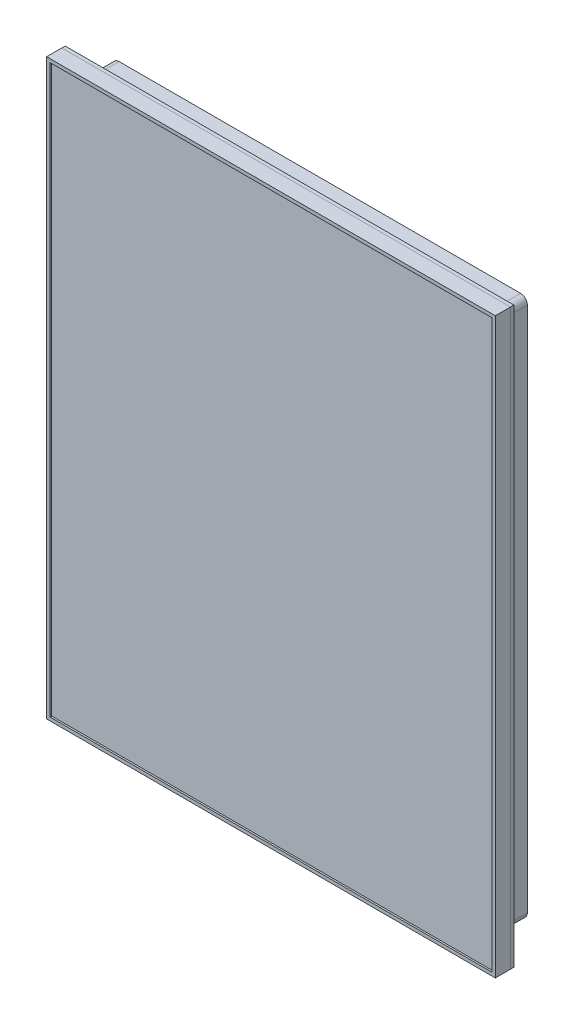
ISO-10303-21;
HEADER;
FILE_DESCRIPTION(('STEP AP214'),'2;1');
FILE_NAME('part.step','',(''),(''),'','','');
FILE_SCHEMA(('AUTOMOTIVE_DESIGN { 1 0 10303 214 1 1 1 1 }'));
ENDSEC;
DATA;
#1=APPLICATION_CONTEXT('core data for automotive mechanical design processes');
#2=APPLICATION_PROTOCOL_DEFINITION('international standard','automotive_design',2000,#1);
#3=PRODUCT_CONTEXT('',#1,'mechanical');
#4=PRODUCT('Part','Part','',(#3));
#5=PRODUCT_RELATED_PRODUCT_CATEGORY('part','',(#4));
#6=PRODUCT_DEFINITION_FORMATION('','',#4);
#7=PRODUCT_DEFINITION_CONTEXT('part definition',#1,'design');
#8=PRODUCT_DEFINITION('design','',#6,#7);
#9=PRODUCT_DEFINITION_SHAPE('','',#8);
#10=(LENGTH_UNIT() NAMED_UNIT(*) SI_UNIT(.MILLI.,.METRE.));
#11=(NAMED_UNIT(*) PLANE_ANGLE_UNIT() SI_UNIT($,.RADIAN.));
#12=(NAMED_UNIT(*) SI_UNIT($,.STERADIAN.) SOLID_ANGLE_UNIT());
#13=UNCERTAINTY_MEASURE_WITH_UNIT(LENGTH_MEASURE(1.E-05),#10,'distance_accuracy_value','');
#14=(GEOMETRIC_REPRESENTATION_CONTEXT(3) GLOBAL_UNCERTAINTY_ASSIGNED_CONTEXT((#13)) GLOBAL_UNIT_ASSIGNED_CONTEXT((#10,
#11,#12)) REPRESENTATION_CONTEXT('',''));
#15=CARTESIAN_POINT('',(0.,0.,0.));
#16=DIRECTION('',(0.,0.,1.));
#17=DIRECTION('',(1.,0.,0.));
#18=AXIS2_PLACEMENT_3D('',#15,#16,#17);
#19=CARTESIAN_POINT('',(-69.2067937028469,-89.2163389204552,-9.5));
#20=DIRECTION('',(-1.,0.,0.));
#21=DIRECTION('',(0.,0.,-1.));
#22=AXIS2_PLACEMENT_3D('',#19,#20,#21);
#23=PLANE('',#22);
#24=CARTESIAN_POINT('',(-69.2067937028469,-89.2163389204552,-9.5));
#25=DIRECTION('',(-1.,0.,0.));
#26=DIRECTION('',(0.,0.,-1.));
#27=AXIS2_PLACEMENT_3D('',#24,#25,#26);
#28=CIRCLE('',#27,1.5);
#29=CARTESIAN_POINT('',(-69.2067937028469,-89.2163389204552,-11.));
#30=VERTEX_POINT('',#29);
#31=EDGE_CURVE('E62',#30,#30,#28,.T.);
#32=ORIENTED_EDGE('',*,*,#31,.T.);
#33=EDGE_LOOP('',(#32));
#34=FACE_BOUND('',#33,.T.);
#35=ADVANCED_FACE('F47',(#34),#23,.T.);
#36=CARTESIAN_POINT('',(0.,-89.,-9.5));
#37=DIRECTION('',(0.,-1.,0.));
#38=DIRECTION('',(0.,0.,-1.));
#39=AXIS2_PLACEMENT_3D('',#36,#37,#38);
#40=PLANE('',#39);
#41=CARTESIAN_POINT('',(0.,-89.,-11.));
#42=CARTESIAN_POINT('',(0.0213772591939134,-89.,-10.9999998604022));
#43=CARTESIAN_POINT('',(0.0427550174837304,-89.,-10.9995613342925));
#44=CARTESIAN_POINT('',(0.0865202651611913,-89.,-10.9977566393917));
#45=CARTESIAN_POINT('',(0.108905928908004,-89.,-10.9963460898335));
#46=CARTESIAN_POINT('',(0.154585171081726,-89.,-10.9924584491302));
#47=CARTESIAN_POINT('',(0.177874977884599,-89.,-10.9899368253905));
#48=CARTESIAN_POINT('',(0.225260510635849,-89.0000000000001,-10.9836881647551));
#49=CARTESIAN_POINT('',(0.249350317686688,-89.0000000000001,-10.9799161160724));
#50=CARTESIAN_POINT('',(0.298234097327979,-89.0000000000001,-10.9710281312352));
#51=CARTESIAN_POINT('',(0.323019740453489,-89.0000000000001,-10.9658662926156));
#52=CARTESIAN_POINT('',(0.373193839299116,-89.0000000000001,-10.9540605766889));
#53=CARTESIAN_POINT('',(0.398571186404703,-89.0000000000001,-10.9473693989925));
#54=CARTESIAN_POINT('',(0.449827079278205,-89.0000000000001,-10.9323676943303));
#55=CARTESIAN_POINT('',(0.475691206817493,-89.0000000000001,-10.9240079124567));
#56=CARTESIAN_POINT('',(0.52782205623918,-89.0000000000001,-10.9055309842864));
#57=CARTESIAN_POINT('',(0.554070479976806,-89.0000000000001,-10.8953619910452));
#58=CARTESIAN_POINT('',(0.593312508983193,-89.0000000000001,-10.8788392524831));
#59=CARTESIAN_POINT('',(0.606540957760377,-89.0000000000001,-10.8730367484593));
#60=CARTESIAN_POINT('',(0.633057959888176,-89.0000000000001,-10.8609349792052));
#61=CARTESIAN_POINT('',(0.646343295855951,-89.0000000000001,-10.8546286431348));
#62=CARTESIAN_POINT('',(0.672960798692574,-89.0000000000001,-10.8415022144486));
#63=CARTESIAN_POINT('',(0.686289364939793,-89.0000000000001,-10.8346748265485));
#64=CARTESIAN_POINT('',(0.712980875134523,-89.0000000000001,-10.8204891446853));
#65=CARTESIAN_POINT('',(0.726339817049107,-89.0000000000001,-10.813123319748));
#66=CARTESIAN_POINT('',(0.753079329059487,-89.0000000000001,-10.7978435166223));
#67=CARTESIAN_POINT('',(0.766455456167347,-89.0000000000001,-10.7899217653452));
#68=CARTESIAN_POINT('',(0.79321713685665,-89.0000000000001,-10.7735134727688));
#69=CARTESIAN_POINT('',(0.806597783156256,-89.0000000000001,-10.7650189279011));
#70=CARTESIAN_POINT('',(0.833354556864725,-89.0000000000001,-10.7474460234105));
#71=CARTESIAN_POINT('',(0.846725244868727,-89.0000000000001,-10.7383593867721));
#72=CARTESIAN_POINT('',(0.873454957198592,-89.0000000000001,-10.7195924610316));
#73=CARTESIAN_POINT('',(0.886808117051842,-89.0000000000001,-10.7099038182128));
#74=CARTESIAN_POINT('',(0.913449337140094,-89.0000000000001,-10.6899028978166));
#75=CARTESIAN_POINT('',(0.926731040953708,-89.0000000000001,-10.6795821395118));
#76=CARTESIAN_POINT('',(0.953156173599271,-89.,-10.6583032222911));
#77=CARTESIAN_POINT('',(0.966293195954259,-89.,-10.6473371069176));
#78=CARTESIAN_POINT('',(0.992394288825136,-89.,-10.6247805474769));
#79=CARTESIAN_POINT('',(1.00535209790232,-89.,-10.6131828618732));
#80=CARTESIAN_POINT('',(1.03105279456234,-89.,-10.5893667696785));
#81=CARTESIAN_POINT('',(1.04378942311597,-89.,-10.5771416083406));
#82=CARTESIAN_POINT('',(1.06900781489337,-89.,-10.5520768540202));
#83=CARTESIAN_POINT('',(1.08148332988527,-89.,-10.5392309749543));
#84=CARTESIAN_POINT('',(1.10613902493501,-89.,-10.512930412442));
#85=CARTESIAN_POINT('',(1.11831292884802,-89.,-10.4994698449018));
#86=CARTESIAN_POINT('',(1.14232510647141,-89.,-10.4719457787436));
#87=CARTESIAN_POINT('',(1.15415704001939,-89.,-10.4578767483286));
#88=CARTESIAN_POINT('',(1.17744500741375,-89.,-10.4291416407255));
#89=CARTESIAN_POINT('',(1.1888945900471,-89.,-10.4144703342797));
#90=CARTESIAN_POINT('',(1.21137753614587,-89.,-10.3845365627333));
#91=CARTESIAN_POINT('',(1.22240427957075,-89.,-10.3692691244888));
#92=CARTESIAN_POINT('',(1.24400169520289,-89.,-10.3381492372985));
#93=CARTESIAN_POINT('',(1.25456551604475,-89.,-10.3222920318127));
#94=CARTESIAN_POINT('',(1.2751957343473,-89.,-10.2899979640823));
#95=CARTESIAN_POINT('',(1.28525495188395,-89.,-10.2735565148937));
#96=CARTESIAN_POINT('',(1.30484064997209,-89.,-10.2401025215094));
#97=CARTESIAN_POINT('',(1.31435960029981,-89.,-10.2230855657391));
#98=CARTESIAN_POINT('',(1.33279917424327,-89.,-10.1884916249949));
#99=CARTESIAN_POINT('',(1.34171214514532,-89.,-10.1709105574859));
#100=CARTESIAN_POINT('',(1.35889271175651,-89.,-10.1352306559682));
#101=CARTESIAN_POINT('',(1.36715339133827,-89.,-10.1171284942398));
#102=CARTESIAN_POINT('',(1.3830096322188,-89.,-10.080453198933));
#103=CARTESIAN_POINT('',(1.39059896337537,-89.,-10.0618773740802));
#104=CARTESIAN_POINT('',(1.40508652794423,-89.,-10.0242985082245));
#105=CARTESIAN_POINT('',(1.41197916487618,-89.,-10.0052933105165));
#106=CARTESIAN_POINT('',(1.4250490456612,-89.,-9.96690037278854));
#107=CARTESIAN_POINT('',(1.43122133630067,-89.,-9.94751094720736));
#108=CARTESIAN_POINT('',(1.44282577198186,-89.,-9.90839406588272));
#109=CARTESIAN_POINT('',(1.44825359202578,-89.,-9.88866532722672));
#110=CARTESIAN_POINT('',(1.4583444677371,-89.,-9.8489144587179));
#111=CARTESIAN_POINT('',(1.46300380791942,-89.,-9.82889138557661));
#112=CARTESIAN_POINT('',(1.47153308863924,-89.,-9.78859653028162));
#113=CARTESIAN_POINT('',(1.47539989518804,-89.,-9.76832408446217));
#114=CARTESIAN_POINT('',(1.48231950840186,-89.,-9.72757523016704));
#115=CARTESIAN_POINT('',(1.48536972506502,-89.,-9.70709838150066));
#116=CARTESIAN_POINT('',(1.4906315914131,-89.,-9.66598551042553));
#117=CARTESIAN_POINT('',(1.49284114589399,-89.,-9.64534921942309));
#118=CARTESIAN_POINT('',(1.49639717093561,-89.,-9.60396233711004));
#119=CARTESIAN_POINT('',(1.49774197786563,-89.,-9.58321160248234));
#120=CARTESIAN_POINT('',(1.49954404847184,-89.,-9.54164061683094));
#121=CARTESIAN_POINT('',(1.5,-89.,-9.52082030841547));
#122=CARTESIAN_POINT('',(1.5,-89.,-9.47917969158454));
#123=CARTESIAN_POINT('',(1.49954404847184,-89.,-9.45835938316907));
#124=CARTESIAN_POINT('',(1.49774197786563,-89.,-9.41678839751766));
#125=CARTESIAN_POINT('',(1.49639717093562,-89.,-9.39603766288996));
#126=CARTESIAN_POINT('',(1.49284114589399,-89.,-9.35465078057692));
#127=CARTESIAN_POINT('',(1.4906315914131,-89.,-9.33401448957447));
#128=CARTESIAN_POINT('',(1.48536972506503,-89.,-9.29290161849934));
#129=CARTESIAN_POINT('',(1.48231950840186,-89.,-9.27242476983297));
#130=CARTESIAN_POINT('',(1.47539989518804,-89.,-9.23167591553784));
#131=CARTESIAN_POINT('',(1.47153308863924,-89.,-9.21140346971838));
#132=CARTESIAN_POINT('',(1.46300380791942,-89.,-9.17110861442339));
#133=CARTESIAN_POINT('',(1.4583444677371,-89.,-9.15108554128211));
#134=CARTESIAN_POINT('',(1.44825359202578,-89.,-9.11133467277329));
#135=CARTESIAN_POINT('',(1.44282577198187,-89.,-9.09160593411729));
#136=CARTESIAN_POINT('',(1.43122133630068,-89.,-9.05248905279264));
#137=CARTESIAN_POINT('',(1.4250490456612,-89.,-9.03309962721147));
#138=CARTESIAN_POINT('',(1.41197916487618,-89.,-8.99470668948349));
#139=CARTESIAN_POINT('',(1.40508652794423,-89.,-8.97570149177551));
#140=CARTESIAN_POINT('',(1.39059896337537,-89.0000000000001,-8.93812262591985));
#141=CARTESIAN_POINT('',(1.38300963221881,-89.0000000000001,-8.91954680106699));
#142=CARTESIAN_POINT('',(1.36715339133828,-89.0000000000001,-8.88287150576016));
#143=CARTESIAN_POINT('',(1.35889271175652,-89.0000000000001,-8.86476934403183));
#144=CARTESIAN_POINT('',(1.34171214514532,-89.0000000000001,-8.82908944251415));
#145=CARTESIAN_POINT('',(1.33279917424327,-89.0000000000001,-8.81150837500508));
#146=CARTESIAN_POINT('',(1.31435960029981,-89.0000000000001,-8.77691443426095));
#147=CARTESIAN_POINT('',(1.30484064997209,-89.0000000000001,-8.75989747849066));
#148=CARTESIAN_POINT('',(1.28525495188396,-89.0000000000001,-8.72644348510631));
#149=CARTESIAN_POINT('',(1.2751957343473,-89.0000000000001,-8.71000203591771));
#150=CARTESIAN_POINT('',(1.25456551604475,-89.0000000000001,-8.67770796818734));
#151=CARTESIAN_POINT('',(1.2440016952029,-89.0000000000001,-8.66185076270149));
#152=CARTESIAN_POINT('',(1.22240427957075,-89.0000000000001,-8.63073087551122));
#153=CARTESIAN_POINT('',(1.21137753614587,-89.0000000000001,-8.61546343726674));
#154=CARTESIAN_POINT('',(1.1888945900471,-89.0000000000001,-8.58552966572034));
#155=CARTESIAN_POINT('',(1.17744500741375,-89.0000000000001,-8.5708583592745));
#156=CARTESIAN_POINT('',(1.15415704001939,-89.,-8.54212325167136));
#157=CARTESIAN_POINT('',(1.14232510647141,-89.,-8.52805422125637));
#158=CARTESIAN_POINT('',(1.11831292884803,-89.,-8.50053015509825));
#159=CARTESIAN_POINT('',(1.10613902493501,-89.,-8.48706958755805));
#160=CARTESIAN_POINT('',(1.08148332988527,-89.,-8.46076902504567));
#161=CARTESIAN_POINT('',(1.06900781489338,-89.,-8.44792314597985));
#162=CARTESIAN_POINT('',(1.04378942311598,-89.,-8.42285839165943));
#163=CARTESIAN_POINT('',(1.03105279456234,-89.,-8.41063323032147));
#164=CARTESIAN_POINT('',(1.00535209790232,-89.,-8.38681713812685));
#165=CARTESIAN_POINT('',(0.99239428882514,-89.,-8.37521945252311));
#166=CARTESIAN_POINT('',(0.966293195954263,-89.,-8.35266289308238));
#167=CARTESIAN_POINT('',(0.953156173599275,-89.,-8.3416967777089));
#168=CARTESIAN_POINT('',(0.926731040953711,-89.,-8.32041786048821));
#169=CARTESIAN_POINT('',(0.913449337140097,-89.,-8.31009710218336));
#170=CARTESIAN_POINT('',(0.886808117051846,-89.,-8.29009618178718));
#171=CARTESIAN_POINT('',(0.873454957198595,-89.,-8.2804075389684));
#172=CARTESIAN_POINT('',(0.846725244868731,-89.,-8.26164061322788));
#173=CARTESIAN_POINT('',(0.83335455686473,-89.,-8.25255397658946));
#174=CARTESIAN_POINT('',(0.806597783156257,-89.,-8.23498107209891));
#175=CARTESIAN_POINT('',(0.793217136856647,-89.,-8.22648652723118));
#176=CARTESIAN_POINT('',(0.766455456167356,-89.,-8.2100782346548));
#177=CARTESIAN_POINT('',(0.753079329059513,-89.,-8.2021564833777));
#178=CARTESIAN_POINT('',(0.726339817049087,-89.,-8.18687668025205));
#179=CARTESIAN_POINT('',(0.712980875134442,-89.,-8.1795108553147));
#180=CARTESIAN_POINT('',(0.686289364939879,-89.,-8.16532517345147));
#181=CARTESIAN_POINT('',(0.672960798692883,-89.,-8.15849778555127));
#182=CARTESIAN_POINT('',(0.646343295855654,-89.,-8.14537135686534));
#183=CARTESIAN_POINT('',(0.633057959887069,-89.,-8.13906502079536));
#184=CARTESIAN_POINT('',(0.60654095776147,-89.,-8.1269632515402));
#185=CARTESIAN_POINT('',(0.59331250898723,-89.,-8.12116074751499));
#186=CARTESIAN_POINT('',(0.554070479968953,-89.,-8.10463800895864));
#187=CARTESIAN_POINT('',(0.527822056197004,-89.,-8.09446901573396));
#188=CARTESIAN_POINT('',(0.475691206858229,-89.,-8.0759920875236));
#189=CARTESIAN_POINT('',(0.449827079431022,-89.,-8.06763230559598));
#190=CARTESIAN_POINT('',(0.398571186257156,-89.,-8.0526306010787));
#191=CARTESIAN_POINT('',(0.373193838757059,-89.,-8.04593942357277));
#192=CARTESIAN_POINT('',(0.323019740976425,-89.,-8.03413370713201));
#193=CARTESIAN_POINT('',(0.298234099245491,-89.,-8.02897186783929));
#194=CARTESIAN_POINT('',(0.249350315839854,-89.,-8.02008388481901));
#195=CARTESIAN_POINT('',(0.225260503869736,-89.,-8.01631183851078));
#196=CARTESIAN_POINT('',(0.177874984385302,-89.,-8.01006317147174));
#197=CARTESIAN_POINT('',(0.15458519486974,-89.,-8.00754153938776));
#198=CARTESIAN_POINT('',(0.108905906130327,-89.,-8.00365392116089));
#199=CARTESIAN_POINT('',(0.0865201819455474,-89.,-8.00224340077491));
#200=CARTESIAN_POINT('',(0.042755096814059,-89.,-8.00043862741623));
#201=CARTESIAN_POINT('',(0.0213775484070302,-89.,-8.));
#202=CARTESIAN_POINT('',(-0.0213775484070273,-89.,-8.));
#203=CARTESIAN_POINT('',(-0.042755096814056,-89.,-8.00043862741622));
#204=CARTESIAN_POINT('',(-0.086520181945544,-89.,-8.00224340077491));
#205=CARTESIAN_POINT('',(-0.108905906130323,-89.,-8.00365392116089));
#206=CARTESIAN_POINT('',(-0.154585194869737,-89.,-8.00754153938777));
#207=CARTESIAN_POINT('',(-0.177874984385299,-89.,-8.01006317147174));
#208=CARTESIAN_POINT('',(-0.225260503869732,-89.,-8.01631183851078));
#209=CARTESIAN_POINT('',(-0.24935031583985,-89.,-8.02008388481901));
#210=CARTESIAN_POINT('',(-0.298234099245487,-89.,-8.02897186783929));
#211=CARTESIAN_POINT('',(-0.323019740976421,-89.,-8.03413370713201));
#212=CARTESIAN_POINT('',(-0.373193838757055,-89.,-8.04593942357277));
#213=CARTESIAN_POINT('',(-0.398571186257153,-89.,-8.0526306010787));
#214=CARTESIAN_POINT('',(-0.449827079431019,-89.,-8.06763230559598));
#215=CARTESIAN_POINT('',(-0.475691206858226,-89.,-8.0759920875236));
#216=CARTESIAN_POINT('',(-0.527822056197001,-89.,-8.09446901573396));
#217=CARTESIAN_POINT('',(-0.55407047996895,-89.,-8.10463800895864));
#218=CARTESIAN_POINT('',(-0.593312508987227,-89.,-8.12116074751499));
#219=CARTESIAN_POINT('',(-0.606540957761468,-89.,-8.1269632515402));
#220=CARTESIAN_POINT('',(-0.633057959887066,-89.,-8.13906502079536));
#221=CARTESIAN_POINT('',(-0.646343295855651,-89.,-8.14537135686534));
#222=CARTESIAN_POINT('',(-0.67296079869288,-89.,-8.15849778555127));
#223=CARTESIAN_POINT('',(-0.686289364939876,-89.,-8.16532517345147));
#224=CARTESIAN_POINT('',(-0.712980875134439,-89.,-8.1795108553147));
#225=CARTESIAN_POINT('',(-0.726339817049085,-89.,-8.18687668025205));
#226=CARTESIAN_POINT('',(-0.75307932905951,-89.,-8.2021564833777));
#227=CARTESIAN_POINT('',(-0.766455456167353,-89.,-8.21007823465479));
#228=CARTESIAN_POINT('',(-0.793217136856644,-89.,-8.22648652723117));
#229=CARTESIAN_POINT('',(-0.806597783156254,-89.,-8.23498107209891));
#230=CARTESIAN_POINT('',(-0.833354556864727,-89.,-8.25255397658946));
#231=CARTESIAN_POINT('',(-0.846725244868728,-89.,-8.26164061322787));
#232=CARTESIAN_POINT('',(-0.873454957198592,-89.,-8.2804075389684));
#233=CARTESIAN_POINT('',(-0.886808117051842,-88.9999999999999,-8.29009618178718));
#234=CARTESIAN_POINT('',(-0.913449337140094,-89.,-8.31009710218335));
#235=CARTESIAN_POINT('',(-0.926731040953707,-89.,-8.32041786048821));
#236=CARTESIAN_POINT('',(-0.953156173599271,-89.,-8.34169677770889));
#237=CARTESIAN_POINT('',(-0.966293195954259,-89.,-8.35266289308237));
#238=CARTESIAN_POINT('',(-0.992394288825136,-89.,-8.3752194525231));
#239=CARTESIAN_POINT('',(-1.00535209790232,-89.,-8.38681713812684));
#240=CARTESIAN_POINT('',(-1.03105279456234,-89.,-8.41063323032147));
#241=CARTESIAN_POINT('',(-1.04378942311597,-89.,-8.42285839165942));
#242=CARTESIAN_POINT('',(-1.06900781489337,-89.,-8.44792314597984));
#243=CARTESIAN_POINT('',(-1.08148332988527,-89.,-8.46076902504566));
#244=CARTESIAN_POINT('',(-1.10613902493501,-89.,-8.48706958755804));
#245=CARTESIAN_POINT('',(-1.11831292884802,-89.,-8.50053015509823));
#246=CARTESIAN_POINT('',(-1.14232510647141,-89.,-8.52805422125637));
#247=CARTESIAN_POINT('',(-1.15415704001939,-89.,-8.54212325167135));
#248=CARTESIAN_POINT('',(-1.17744500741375,-89.,-8.57085835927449));
#249=CARTESIAN_POINT('',(-1.1888945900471,-89.,-8.58552966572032));
#250=CARTESIAN_POINT('',(-1.21137753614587,-89.,-8.61546343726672));
#251=CARTESIAN_POINT('',(-1.22240427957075,-89.,-8.63073087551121));
#252=CARTESIAN_POINT('',(-1.24400169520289,-89.,-8.66185076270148));
#253=CARTESIAN_POINT('',(-1.25456551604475,-89.,-8.67770796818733));
#254=CARTESIAN_POINT('',(-1.2751957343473,-89.,-8.7100020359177));
#255=CARTESIAN_POINT('',(-1.28525495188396,-89.,-8.7264434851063));
#256=CARTESIAN_POINT('',(-1.30484064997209,-89.,-8.75989747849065));
#257=CARTESIAN_POINT('',(-1.31435960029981,-89.,-8.77691443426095));
#258=CARTESIAN_POINT('',(-1.33279917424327,-89.,-8.81150837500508));
#259=CARTESIAN_POINT('',(-1.34171214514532,-89.,-8.82908944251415));
#260=CARTESIAN_POINT('',(-1.35889271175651,-89.,-8.86476934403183));
#261=CARTESIAN_POINT('',(-1.36715339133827,-89.,-8.88287150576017));
#262=CARTESIAN_POINT('',(-1.38300963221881,-89.,-8.919546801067));
#263=CARTESIAN_POINT('',(-1.39059896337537,-89.,-8.93812262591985));
#264=CARTESIAN_POINT('',(-1.40508652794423,-89.,-8.97570149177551));
#265=CARTESIAN_POINT('',(-1.41197916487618,-89.,-8.99470668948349));
#266=CARTESIAN_POINT('',(-1.4250490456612,-89.,-9.03309962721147));
#267=CARTESIAN_POINT('',(-1.43122133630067,-89.,-9.05248905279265));
#268=CARTESIAN_POINT('',(-1.44282577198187,-89.,-9.09160593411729));
#269=CARTESIAN_POINT('',(-1.44825359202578,-89.,-9.11133467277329));
#270=CARTESIAN_POINT('',(-1.4583444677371,-89.,-9.15108554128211));
#271=CARTESIAN_POINT('',(-1.46300380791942,-89.,-9.17110861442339));
#272=CARTESIAN_POINT('',(-1.47153308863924,-89.,-9.21140346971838));
#273=CARTESIAN_POINT('',(-1.47539989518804,-89.,-9.23167591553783));
#274=CARTESIAN_POINT('',(-1.48231950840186,-89.,-9.27242476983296));
#275=CARTESIAN_POINT('',(-1.48536972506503,-89.0000000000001,-9.29290161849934));
#276=CARTESIAN_POINT('',(-1.4906315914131,-89.0000000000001,-9.33401448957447));
#277=CARTESIAN_POINT('',(-1.49284114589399,-89.0000000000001,-9.35465078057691));
#278=CARTESIAN_POINT('',(-1.49639717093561,-89.,-9.39603766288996));
#279=CARTESIAN_POINT('',(-1.49774197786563,-89.,-9.41678839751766));
#280=CARTESIAN_POINT('',(-1.49954404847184,-89.,-9.45835938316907));
#281=CARTESIAN_POINT('',(-1.5,-89.0000000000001,-9.47917969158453));
#282=CARTESIAN_POINT('',(-1.5,-89.0000000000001,-9.52082030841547));
#283=CARTESIAN_POINT('',(-1.49954404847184,-89.0000000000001,-9.54164061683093));
#284=CARTESIAN_POINT('',(-1.49774197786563,-89.0000000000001,-9.58321160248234));
#285=CARTESIAN_POINT('',(-1.49639717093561,-89.0000000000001,-9.60396233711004));
#286=CARTESIAN_POINT('',(-1.49284114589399,-89.0000000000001,-9.64534921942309));
#287=CARTESIAN_POINT('',(-1.4906315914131,-89.0000000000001,-9.66598551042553));
#288=CARTESIAN_POINT('',(-1.48536972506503,-89.0000000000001,-9.70709838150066));
#289=CARTESIAN_POINT('',(-1.48231950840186,-89.,-9.72757523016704));
#290=CARTESIAN_POINT('',(-1.47539989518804,-89.,-9.76832408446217));
#291=CARTESIAN_POINT('',(-1.47153308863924,-89.,-9.78859653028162));
#292=CARTESIAN_POINT('',(-1.46300380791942,-89.,-9.82889138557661));
#293=CARTESIAN_POINT('',(-1.4583444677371,-89.,-9.8489144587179));
#294=CARTESIAN_POINT('',(-1.44825359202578,-89.,-9.88866532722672));
#295=CARTESIAN_POINT('',(-1.44282577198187,-89.,-9.90839406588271));
#296=CARTESIAN_POINT('',(-1.43122133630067,-89.,-9.94751094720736));
#297=CARTESIAN_POINT('',(-1.4250490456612,-89.,-9.96690037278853));
#298=CARTESIAN_POINT('',(-1.41197916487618,-89.,-10.0052933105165));
#299=CARTESIAN_POINT('',(-1.40508652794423,-89.,-10.0242985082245));
#300=CARTESIAN_POINT('',(-1.39059896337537,-89.,-10.0618773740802));
#301=CARTESIAN_POINT('',(-1.3830096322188,-89.,-10.080453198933));
#302=CARTESIAN_POINT('',(-1.36715339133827,-89.,-10.1171284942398));
#303=CARTESIAN_POINT('',(-1.35889271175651,-89.,-10.1352306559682));
#304=CARTESIAN_POINT('',(-1.34171214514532,-89.,-10.1709105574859));
#305=CARTESIAN_POINT('',(-1.33279917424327,-89.,-10.1884916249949));
#306=CARTESIAN_POINT('',(-1.31435960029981,-89.,-10.2230855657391));
#307=CARTESIAN_POINT('',(-1.30484064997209,-89.,-10.2401025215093));
#308=CARTESIAN_POINT('',(-1.28525495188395,-89.,-10.2735565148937));
#309=CARTESIAN_POINT('',(-1.2751957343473,-89.,-10.2899979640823));
#310=CARTESIAN_POINT('',(-1.25456551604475,-89.,-10.3222920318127));
#311=CARTESIAN_POINT('',(-1.24400169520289,-89.,-10.3381492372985));
#312=CARTESIAN_POINT('',(-1.22240427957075,-89.,-10.3692691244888));
#313=CARTESIAN_POINT('',(-1.21137753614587,-89.,-10.3845365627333));
#314=CARTESIAN_POINT('',(-1.1888945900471,-89.,-10.4144703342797));
#315=CARTESIAN_POINT('',(-1.17744500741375,-89.,-10.4291416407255));
#316=CARTESIAN_POINT('',(-1.15415704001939,-89.,-10.4578767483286));
#317=CARTESIAN_POINT('',(-1.14232510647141,-89.,-10.4719457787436));
#318=CARTESIAN_POINT('',(-1.11831292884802,-89.,-10.4994698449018));
#319=CARTESIAN_POINT('',(-1.10613902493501,-89.,-10.5129304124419));
#320=CARTESIAN_POINT('',(-1.08148332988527,-89.,-10.5392309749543));
#321=CARTESIAN_POINT('',(-1.06900781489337,-89.,-10.5520768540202));
#322=CARTESIAN_POINT('',(-1.04378942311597,-89.,-10.5771416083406));
#323=CARTESIAN_POINT('',(-1.03105279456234,-89.,-10.5893667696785));
#324=CARTESIAN_POINT('',(-1.00535209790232,-89.,-10.6131828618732));
#325=CARTESIAN_POINT('',(-0.992394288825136,-89.,-10.6247805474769));
#326=CARTESIAN_POINT('',(-0.966293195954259,-89.,-10.6473371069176));
#327=CARTESIAN_POINT('',(-0.953156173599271,-89.,-10.6583032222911));
#328=CARTESIAN_POINT('',(-0.926731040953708,-89.,-10.6795821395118));
#329=CARTESIAN_POINT('',(-0.913449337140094,-89.,-10.6899028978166));
#330=CARTESIAN_POINT('',(-0.886808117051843,-89.,-10.7099038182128));
#331=CARTESIAN_POINT('',(-0.873454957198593,-89.0000000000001,-10.7195924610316));
#332=CARTESIAN_POINT('',(-0.846725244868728,-89.0000000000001,-10.7383593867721));
#333=CARTESIAN_POINT('',(-0.833354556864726,-89.,-10.7474460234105));
#334=CARTESIAN_POINT('',(-0.806597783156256,-89.,-10.7650189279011));
#335=CARTESIAN_POINT('',(-0.79321713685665,-89.,-10.7735134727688));
#336=CARTESIAN_POINT('',(-0.766455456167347,-89.,-10.7899217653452));
#337=CARTESIAN_POINT('',(-0.753079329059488,-89.,-10.7978435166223));
#338=CARTESIAN_POINT('',(-0.726339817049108,-89.,-10.813123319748));
#339=CARTESIAN_POINT('',(-0.712980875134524,-89.,-10.8204891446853));
#340=CARTESIAN_POINT('',(-0.686289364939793,-89.,-10.8346748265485));
#341=CARTESIAN_POINT('',(-0.672960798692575,-89.,-10.8415022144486));
#342=CARTESIAN_POINT('',(-0.646343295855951,-89.,-10.8546286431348));
#343=CARTESIAN_POINT('',(-0.633057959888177,-89.,-10.8609349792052));
#344=CARTESIAN_POINT('',(-0.606540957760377,-89.,-10.8730367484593));
#345=CARTESIAN_POINT('',(-0.593312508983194,-89.,-10.8788392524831));
#346=CARTESIAN_POINT('',(-0.554070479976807,-89.,-10.8953619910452));
#347=CARTESIAN_POINT('',(-0.527822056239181,-89.,-10.9055309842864));
#348=CARTESIAN_POINT('',(-0.475691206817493,-89.,-10.9240079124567));
#349=CARTESIAN_POINT('',(-0.449827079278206,-89.,-10.9323676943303));
#350=CARTESIAN_POINT('',(-0.398571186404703,-89.,-10.9473693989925));
#351=CARTESIAN_POINT('',(-0.373193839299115,-89.,-10.9540605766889));
#352=CARTESIAN_POINT('',(-0.323019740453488,-89.,-10.9658662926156));
#353=CARTESIAN_POINT('',(-0.298234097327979,-89.,-10.9710281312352));
#354=CARTESIAN_POINT('',(-0.249350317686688,-89.,-10.9799161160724));
#355=CARTESIAN_POINT('',(-0.225260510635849,-89.,-10.9836881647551));
#356=CARTESIAN_POINT('',(-0.177874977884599,-89.,-10.9899368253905));
#357=CARTESIAN_POINT('',(-0.154585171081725,-89.0000000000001,-10.9924584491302));
#358=CARTESIAN_POINT('',(-0.108905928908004,-89.0000000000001,-10.9963460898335));
#359=CARTESIAN_POINT('',(-0.086520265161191,-89.,-10.9977566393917));
#360=CARTESIAN_POINT('',(-0.0427550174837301,-89.,-10.9995613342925));
#361=CARTESIAN_POINT('',(-0.021377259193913,-89.,-10.9999998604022));
#362=CARTESIAN_POINT('',(0.,-89.,-11.));
#363=B_SPLINE_CURVE_WITH_KNOTS('',3,(#41,#42,#43,#44,#45,#46,#47,#48,#49,#50,#51,#52,#53,#54,
#55,#56,#57,#58,#59,#60,#61,#62,#63,#64,#65,#66,#67,#68,#69,#70,#71,#72,#73,#74,#75,#76,#77,#78,
#79,#80,#81,#82,#83,#84,#85,#86,#87,#88,#89,#90,#91,#92,#93,#94,#95,#96,#97,#98,#99,#100,#101,
#102,#103,#104,#105,#106,#107,#108,#109,#110,#111,#112,#113,#114,#115,#116,#117,#118,#119,#120,
#121,#122,#123,#124,#125,#126,#127,#128,#129,#130,#131,#132,#133,#134,#135,#136,#137,#138,#139,
#140,#141,#142,#143,#144,#145,#146,#147,#148,#149,#150,#151,#152,#153,#154,#155,#156,#157,#158,
#159,#160,#161,#162,#163,#164,#165,#166,#167,#168,#169,#170,#171,#172,#173,#174,#175,#176,#177,
#178,#179,#180,#181,#182,#183,#184,#185,#186,#187,#188,#189,#190,#191,#192,#193,#194,#195,#196,
#197,#198,#199,#200,#201,#202,#203,#204,#205,#206,#207,#208,#209,#210,#211,#212,#213,#214,#215,
#216,#217,#218,#219,#220,#221,#222,#223,#224,#225,#226,#227,#228,#229,#230,#231,#232,#233,#234,
#235,#236,#237,#238,#239,#240,#241,#242,#243,#244,#245,#246,#247,#248,#249,#250,#251,#252,#253,
#254,#255,#256,#257,#258,#259,#260,#261,#262,#263,#264,#265,#266,#267,#268,#269,#270,#271,#272,
#273,#274,#275,#276,#277,#278,#279,#280,#281,#282,#283,#284,#285,#286,#287,#288,#289,#290,#291,
#292,#293,#294,#295,#296,#297,#298,#299,#300,#301,#302,#303,#304,#305,#306,#307,#308,#309,#310,
#311,#312,#313,#314,#315,#316,#317,#318,#319,#320,#321,#322,#323,#324,#325,#326,#327,#328,#329,
#330,#331,#332,#333,#334,#335,#336,#337,#338,#339,#340,#341,#342,#343,#344,#345,#346,#347,#348,
#349,#350,#351,#352,#353,#354,#355,#356,#357,#358,#359,#360,#361,#362),.UNSPECIFIED.,.F.,.F.,(4,
2,2,2,2,2,2,2,2,2,2,2,2,2,2,2,2,2,2,2,2,2,2,2,2,2,2,2,2,2,2,2,2,2,2,2,2,2,2,2,2,2,2,2,2,2,2,2,2,
2,2,2,2,2,2,2,2,2,2,2,2,2,2,2,2,2,2,2,2,2,2,2,2,2,2,2,2,2,2,2,2,2,2,2,2,2,2,2,2,2,2,2,2,2,2,2,2,
2,2,2,2,2,2,2,2,2,2,2,2,2,2,2,2,2,2,2,2,2,2,2,2,2,2,2,2,2,2,2,2,2,2,2,2,2,2,2,2,2,2,2,2,2,2,2,2,
2,2,2,2,2,2,2,2,2,2,2,2,2,2,2,4),(0.,0.0641281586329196,0.131397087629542,0.201649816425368,
0.274770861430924,0.350689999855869,0.429385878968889,0.510889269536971,0.59528574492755,
0.638615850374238,0.682727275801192,0.727646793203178,0.773404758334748,0.820035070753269,
0.867575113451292,0.916065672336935,0.965550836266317,1.01600175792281,1.06732878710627,
1.11948833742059,1.17244058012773,1.22614996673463,1.28058574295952,1.3357224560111,
1.39154045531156,1.44802638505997,1.50517366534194,1.56298295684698,1.62146260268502,
1.68057967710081,1.74025696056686,1.80044000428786,1.86107339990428,1.92210181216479,
1.98347097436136,2.04512866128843,2.10702565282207,2.16911669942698,2.2313614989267,
2.29372569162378,2.35618187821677,2.41863806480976,2.48100225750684,2.54324705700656,
2.60533810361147,2.66723509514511,2.72889278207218,2.79026194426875,2.85129035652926,
2.91192375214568,2.97210679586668,3.03178407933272,3.09090115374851,3.14938079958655,
3.20719009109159,3.26433737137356,3.32082330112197,3.37664130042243,3.43177801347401,
3.4862137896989,3.5399231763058,3.59287541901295,3.64503496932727,3.69636199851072,
3.74681292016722,3.7962980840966,3.84478864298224,3.89232868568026,3.93895899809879,
3.98471696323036,4.02963648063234,4.0737479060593,4.11707801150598,4.20147448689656,
4.28297787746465,4.36167375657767,4.43759289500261,4.51071394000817,4.580966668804,
4.64823559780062,4.71236375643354,4.77649191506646,4.84376084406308,4.91401357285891,
4.98713461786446,5.06305375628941,5.14174963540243,5.22325302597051,5.30764950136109,
5.35097960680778,5.39509103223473,5.44001054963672,5.48576851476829,5.53239882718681,
5.57993886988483,5.62842942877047,5.67791459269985,5.72836551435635,5.7796925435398,
5.83185209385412,5.88480433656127,5.93851372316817,5.99294949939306,6.04808621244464,
6.1039042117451,6.16039014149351,6.21753742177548,6.27534671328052,6.33382635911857,
6.39294343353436,6.45262071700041,6.5128037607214,6.57343715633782,6.63446556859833,
6.6958347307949,6.75749241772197,6.81938940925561,6.88148045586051,6.94372525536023,
7.00608944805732,7.06854563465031,7.1310018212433,7.19336601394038,7.2556108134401,
7.31770186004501,7.37959885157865,7.44125653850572,7.50262570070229,7.5636541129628,
7.62428750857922,7.68447055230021,7.74414783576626,7.80326491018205,7.86174455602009,
7.91955384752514,7.9767011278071,8.03318705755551,8.08900505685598,8.14414176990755,
8.19857754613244,8.25228693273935,8.30523917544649,8.35739872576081,8.40872575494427,
8.45917667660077,8.50866184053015,8.55715239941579,8.60469244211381,8.65132275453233,
8.69708071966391,8.74200023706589,8.78611166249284,8.82944176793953,8.91383824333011,
8.99534163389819,9.07403751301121,9.14995665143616,9.22307769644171,9.29333042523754,
9.36059935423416,9.42472751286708),.UNSPECIFIED.);
#364=CARTESIAN_POINT('',(0.,-89.,-11.));
#365=VERTEX_POINT('',#364);
#366=EDGE_CURVE('E12',#365,#365,#363,.T.);
#367=ORIENTED_EDGE('',*,*,#366,.F.);
#368=EDGE_LOOP('',(#367));
#369=FACE_BOUND('',#368,.T.);
#370=ADVANCED_FACE('F70',(#369),#40,.F.);
#371=CARTESIAN_POINT('',(-15.1418066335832,-89.2163389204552,-9.5));
#372=DIRECTION('',(-1.,0.,0.));
#373=DIRECTION('',(0.,0.,1.));
#374=AXIS2_PLACEMENT_3D('',#371,#372,#373);
#375=CYLINDRICAL_SURFACE('',#374,1.5);
#376=ORIENTED_EDGE('',*,*,#31,.F.);
#377=EDGE_LOOP('',(#376));
#378=FACE_BOUND('',#377,.T.);
#379=CARTESIAN_POINT('',(-15.1418066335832,-89.2163389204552,-11.));
#380=CARTESIAN_POINT('',(-15.1418066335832,-88.9663389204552,-11.));
#381=CARTESIAN_POINT('',(-15.1418066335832,-88.6363389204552,-10.94));
#382=CARTESIAN_POINT('',(-15.1418066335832,-88.1563389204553,-10.58));
#383=CARTESIAN_POINT('',(-15.1418066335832,-88.0035361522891,-10.4134948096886));
#384=CARTESIAN_POINT('',(-15.1418066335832,-87.782082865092,-9.99826989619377));
#385=CARTESIAN_POINT('',(-15.1418066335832,-87.7163389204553,-9.75000000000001));
#386=CARTESIAN_POINT('',(-15.1418066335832,-87.7163389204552,-9.24999999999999));
#387=CARTESIAN_POINT('',(-15.1418066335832,-87.7820828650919,-9.00173010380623));
#388=CARTESIAN_POINT('',(-15.1418066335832,-88.0035361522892,-8.58650519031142));
#389=CARTESIAN_POINT('',(-15.1418066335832,-88.1563389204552,-8.41999999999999));
#390=CARTESIAN_POINT('',(-15.1418066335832,-88.6363389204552,-8.06));
#391=CARTESIAN_POINT('',(-15.1418066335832,-88.9663389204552,-8.00000000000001));
#392=CARTESIAN_POINT('',(-15.1418066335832,-89.4663389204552,-8.00000000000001));
#393=CARTESIAN_POINT('',(-15.1418066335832,-89.7963389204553,-8.05999999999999));
#394=CARTESIAN_POINT('',(-15.1418066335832,-90.2763389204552,-8.41999999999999));
#395=CARTESIAN_POINT('',(-15.1418066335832,-90.4291416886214,-8.58650519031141));
#396=CARTESIAN_POINT('',(-15.1418066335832,-90.6505949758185,-9.00173010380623));
#397=CARTESIAN_POINT('',(-15.1418066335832,-90.7163389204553,-9.25000000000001));
#398=CARTESIAN_POINT('',(-15.1418066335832,-90.7163389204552,-9.75));
#399=CARTESIAN_POINT('',(-15.1418066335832,-90.6505949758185,-9.99826989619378));
#400=CARTESIAN_POINT('',(-15.1418066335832,-90.4291416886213,-10.4134948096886));
#401=CARTESIAN_POINT('',(-15.1418066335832,-90.2763389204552,-10.58));
#402=CARTESIAN_POINT('',(-15.1418066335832,-89.7963389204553,-10.94));
#403=CARTESIAN_POINT('',(-15.1418066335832,-89.4663389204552,-11.));
#404=CARTESIAN_POINT('',(-15.1418066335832,-89.2163389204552,-11.));
#405=B_SPLINE_CURVE_WITH_KNOTS('',3,(#379,#380,#381,#382,#383,#384,#385,#386,#387,#388,#389,
#390,#391,#392,#393,#394,#395,#396,#397,#398,#399,#400,#401,#402,#403,#404),.UNSPECIFIED.,.T.,
.F.,(4,2,2,2,2,2,2,2,2,2,2,2,4),(0.,0.125,0.1875,0.25,0.3125,0.375,0.5,0.625,0.6875,0.75,0.8125,
0.875,1.),.UNSPECIFIED.);
#406=CARTESIAN_POINT('',(-15.1418066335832,-89.2163389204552,-11.));
#407=VERTEX_POINT('',#406);
#408=EDGE_CURVE('E57',#407,#407,#405,.T.);
#409=ORIENTED_EDGE('',*,*,#408,.F.);
#410=EDGE_LOOP('',(#409));
#411=FACE_BOUND('',#410,.T.);
#412=ADVANCED_FACE('F89',(#378,#411),#375,.T.);
#413=CARTESIAN_POINT('',(0.,-89.0000000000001,-11.));
#414=CARTESIAN_POINT('',(4.31338566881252E-09,-96.7459224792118,-11.));
#415=CARTESIAN_POINT('',(-3.83874471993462,-89.2751670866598,-10.999999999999));
#416=CARTESIAN_POINT('',(-15.0538501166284,-89.2164542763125,-11.));
#417=CARTESIAN_POINT('',(-15.1078076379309,-89.2163389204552,-11.));
#418=CARTESIAN_POINT('',(-15.1418066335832,-89.2163389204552,-11.));
#419=CARTESIAN_POINT('',(0.25,-89.,-11.));
#420=CARTESIAN_POINT('',(0.166992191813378,-96.828930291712,-11.0000000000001));
#421=CARTESIAN_POINT('',(-3.75476034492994,-89.4411827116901,-10.9999999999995));
#422=CARTESIAN_POINT('',(-15.0531990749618,-89.4658032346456,-11.));
#423=CARTESIAN_POINT('',(-15.1074821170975,-89.4660133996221,-11.));
#424=CARTESIAN_POINT('',(-15.1418066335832,-89.4663389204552,-11.));
#425=CARTESIAN_POINT('',(0.58,-89.0000000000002,-10.94));
#426=CARTESIAN_POINT('',(0.387421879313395,-96.9385006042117,-10.94));
#427=CARTESIAN_POINT('',(-3.6439009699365,-89.6603233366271,-10.9399999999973));
#428=CARTESIAN_POINT('',(-15.0523396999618,-89.7949438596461,-10.94));
#429=CARTESIAN_POINT('',(-15.1070524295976,-89.7955837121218,-10.94));
#430=CARTESIAN_POINT('',(-15.1418066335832,-89.7963389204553,-10.94));
#431=CARTESIAN_POINT('',(1.06,-89.,-10.58));
#432=CARTESIAN_POINT('',(0.708046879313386,-97.0978756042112,-10.58));
#433=CARTESIAN_POINT('',(-3.48265096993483,-89.9790733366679,-10.5800000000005));
#434=CARTESIAN_POINT('',(-15.0510896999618,-90.2736938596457,-10.58));
#435=CARTESIAN_POINT('',(-15.1064274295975,-90.2749587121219,-10.58));
#436=CARTESIAN_POINT('',(-15.1418066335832,-90.2763389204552,-10.58));
#437=CARTESIAN_POINT('',(1.21280276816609,-89.0000000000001,-10.4134948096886));
#438=CARTESIAN_POINT('',(0.810114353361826,-97.1486108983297,-10.4134948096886));
#439=CARTESIAN_POINT('',(-3.43131879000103,-90.0805439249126,-10.4134948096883));
#440=CARTESIAN_POINT('',(-15.0506917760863,-90.4260987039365,-10.4134948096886));
#441=CARTESIAN_POINT('',(-15.1062284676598,-90.4275625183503,-10.4134948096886));
#442=CARTESIAN_POINT('',(-15.1418066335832,-90.4291416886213,-10.4134948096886));
#443=CARTESIAN_POINT('',(1.43425605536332,-89.0000000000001,-9.99826989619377));
#444=CARTESIAN_POINT('',(0.958038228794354,-97.222140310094,-9.99826989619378));
#445=CARTESIAN_POINT('',(-3.3569243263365,-90.2276027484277,-9.99826989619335));
#446=CARTESIAN_POINT('',(-15.0501150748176,-90.6469752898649,-9.99826989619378));
#447=CARTESIAN_POINT('',(-15.1059401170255,-90.6487274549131,-9.99826989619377));
#448=CARTESIAN_POINT('',(-15.1418066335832,-90.6505949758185,-9.99826989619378));
#449=CARTESIAN_POINT('',(1.5,-89.0000000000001,-9.74999999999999));
#450=CARTESIAN_POINT('',(1.00195312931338,-97.2439693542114,-9.75000000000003));
#451=CARTESIAN_POINT('',(-3.33483846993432,-90.2712608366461,-9.74999999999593));
#452=CARTESIAN_POINT('',(-15.0499438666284,-90.7125480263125,-9.75000000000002));
#453=CARTESIAN_POINT('',(-15.1058545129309,-90.7143857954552,-9.75000000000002));
#454=CARTESIAN_POINT('',(-15.1418066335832,-90.7163389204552,-9.75));
#455=CARTESIAN_POINT('',(1.5,-89.,-9.25));
#456=CARTESIAN_POINT('',(1.00195312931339,-97.2439693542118,-9.24999999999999));
#457=CARTESIAN_POINT('',(-3.33483846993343,-90.2712608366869,-9.2500000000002));
#458=CARTESIAN_POINT('',(-15.0499438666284,-90.7125480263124,-9.25000000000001));
#459=CARTESIAN_POINT('',(-15.1058545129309,-90.7143857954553,-9.24999999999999));
#460=CARTESIAN_POINT('',(-15.1418066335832,-90.7163389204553,-9.25000000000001));
#461=CARTESIAN_POINT('',(1.43425605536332,-89.,-9.00173010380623));
#462=CARTESIAN_POINT('',(0.958038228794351,-97.222140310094,-9.00173010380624));
#463=CARTESIAN_POINT('',(-3.35692432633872,-90.227602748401,-9.00173010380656));
#464=CARTESIAN_POINT('',(-15.0501150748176,-90.646975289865,-9.00173010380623));
#465=CARTESIAN_POINT('',(-15.1059401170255,-90.648727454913,-9.00173010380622));
#466=CARTESIAN_POINT('',(-15.1418066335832,-90.6505949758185,-9.00173010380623));
#467=CARTESIAN_POINT('',(1.21280276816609,-89.0000000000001,-8.58650519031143));
#468=CARTESIAN_POINT('',(0.81011435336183,-97.148610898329,-8.58650519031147));
#469=CARTESIAN_POINT('',(-3.43131879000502,-90.0805439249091,-8.58650519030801));
#470=CARTESIAN_POINT('',(-15.0506917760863,-90.4260987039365,-8.58650519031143));
#471=CARTESIAN_POINT('',(-15.1062284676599,-90.4275625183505,-8.58650519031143));
#472=CARTESIAN_POINT('',(-15.1418066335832,-90.4291416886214,-8.58650519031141));
#473=CARTESIAN_POINT('',(1.06,-89.,-8.42));
#474=CARTESIAN_POINT('',(0.708046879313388,-97.0978756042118,-8.41999999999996));
#475=CARTESIAN_POINT('',(-3.48265096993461,-89.9790733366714,-8.41999999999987));
#476=CARTESIAN_POINT('',(-15.0510896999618,-90.2736938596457,-8.41999999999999));
#477=CARTESIAN_POINT('',(-15.1064274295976,-90.2749587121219,-8.41999999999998));
#478=CARTESIAN_POINT('',(-15.1418066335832,-90.2763389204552,-8.41999999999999));
#479=CARTESIAN_POINT('',(0.580000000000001,-89.,-8.06));
#480=CARTESIAN_POINT('',(0.387421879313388,-96.938500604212,-8.06000000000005));
#481=CARTESIAN_POINT('',(-3.64390096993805,-89.660323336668,-8.0599999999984));
#482=CARTESIAN_POINT('',(-15.0523396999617,-89.7949438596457,-8.06));
#483=CARTESIAN_POINT('',(-15.1070524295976,-89.795583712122,-8.05999999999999));
#484=CARTESIAN_POINT('',(-15.1418066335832,-89.7963389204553,-8.05999999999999));
#485=CARTESIAN_POINT('',(0.25,-89.,-8.));
#486=CARTESIAN_POINT('',(0.166992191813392,-96.8289302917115,-7.99999999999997));
#487=CARTESIAN_POINT('',(-3.75476034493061,-89.4411827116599,-7.99999999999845));
#488=CARTESIAN_POINT('',(-15.0531990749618,-89.4658032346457,-8.00000000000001));
#489=CARTESIAN_POINT('',(-15.1074821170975,-89.4660133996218,-8.00000000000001));
#490=CARTESIAN_POINT('',(-15.1418066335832,-89.4663389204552,-8.00000000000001));
#491=CARTESIAN_POINT('',(-0.25,-89.,-8.));
#492=CARTESIAN_POINT('',(-0.166992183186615,-96.6629146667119,-8.00000000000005));
#493=CARTESIAN_POINT('',(-3.92272909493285,-89.1091514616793,-8.00000000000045));
#494=CARTESIAN_POINT('',(-15.0545011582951,-88.967105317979,-8.));
#495=CARTESIAN_POINT('',(-15.1081331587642,-88.9666644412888,-8.));
#496=CARTESIAN_POINT('',(-15.1418066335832,-88.9663389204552,-8.00000000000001));
#497=CARTESIAN_POINT('',(-0.58,-89.,-8.06000000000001));
#498=CARTESIAN_POINT('',(-0.387421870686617,-96.5533443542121,-8.05999999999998));
#499=CARTESIAN_POINT('',(-4.03358846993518,-88.8900108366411,-8.05999999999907));
#500=CARTESIAN_POINT('',(-15.0553605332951,-88.6379646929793,-8.06000000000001));
#501=CARTESIAN_POINT('',(-15.1085628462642,-88.6370941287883,-8.06));
#502=CARTESIAN_POINT('',(-15.1418066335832,-88.6363389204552,-8.06));
#503=CARTESIAN_POINT('',(-1.06,-88.9999999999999,-8.41999999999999));
#504=CARTESIAN_POINT('',(-0.708046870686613,-96.3939693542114,-8.41999999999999));
#505=CARTESIAN_POINT('',(-4.19483846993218,-88.5712608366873,-8.41999999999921));
#506=CARTESIAN_POINT('',(-15.0566105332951,-88.159214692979,-8.42));
#507=CARTESIAN_POINT('',(-15.1091878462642,-88.1577191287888,-8.42));
#508=CARTESIAN_POINT('',(-15.1418066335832,-88.1563389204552,-8.41999999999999));
#509=CARTESIAN_POINT('',(-1.21280276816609,-89.0000000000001,-8.58650519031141));
#510=CARTESIAN_POINT('',(-0.81011434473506,-96.3432340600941,-8.58650519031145));
#511=CARTESIAN_POINT('',(-4.24617064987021,-88.4697902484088,-8.58650519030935));
#512=CARTESIAN_POINT('',(-15.0570084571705,-88.0068098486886,-8.58650519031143));
#513=CARTESIAN_POINT('',(-15.1093868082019,-88.00511532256,-8.58650519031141));
#514=CARTESIAN_POINT('',(-15.1418066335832,-88.0035361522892,-8.58650519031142));
#515=CARTESIAN_POINT('',(-1.43425605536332,-89.,-9.00173010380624));
#516=CARTESIAN_POINT('',(-0.95803822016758,-96.2697046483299,-9.00173010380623));
#517=CARTESIAN_POINT('',(-4.32056511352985,-88.3227314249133,-9.00173010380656));
#518=CARTESIAN_POINT('',(-15.0575851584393,-87.78593326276,-9.00173010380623));
#519=CARTESIAN_POINT('',(-15.1096751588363,-87.7839503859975,-9.00173010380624));
#520=CARTESIAN_POINT('',(-15.1418066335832,-87.7820828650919,-9.00173010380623));
#521=CARTESIAN_POINT('',(-1.5,-89.0000000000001,-9.24999999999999));
#522=CARTESIAN_POINT('',(-1.00195312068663,-96.2478756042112,-9.25));
#523=CARTESIAN_POINT('',(-4.34265096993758,-88.279073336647,-9.24999999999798));
#524=CARTESIAN_POINT('',(-15.0577563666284,-87.7203605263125,-9.25000000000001));
#525=CARTESIAN_POINT('',(-15.1097607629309,-87.7182920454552,-9.24999999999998));
#526=CARTESIAN_POINT('',(-15.1418066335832,-87.7163389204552,-9.24999999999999));
#527=CARTESIAN_POINT('',(-1.5,-89.0000000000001,-9.75000000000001));
#528=CARTESIAN_POINT('',(-1.00195312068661,-96.2478756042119,-9.74999999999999));
#529=CARTESIAN_POINT('',(-4.34265096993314,-88.2790733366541,-9.74999999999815));
#530=CARTESIAN_POINT('',(-15.0577563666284,-87.7203605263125,-9.75000000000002));
#531=CARTESIAN_POINT('',(-15.1097607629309,-87.7182920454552,-9.75000000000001));
#532=CARTESIAN_POINT('',(-15.1418066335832,-87.7163389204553,-9.75000000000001));
#533=CARTESIAN_POINT('',(-1.43425605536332,-89.0000000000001,-9.99826989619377));
#534=CARTESIAN_POINT('',(-0.958038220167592,-96.2697046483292,-9.99826989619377));
#535=CARTESIAN_POINT('',(-4.32056511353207,-88.3227314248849,-9.99826989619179));
#536=CARTESIAN_POINT('',(-15.0575851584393,-87.7859332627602,-9.99826989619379));
#537=CARTESIAN_POINT('',(-15.1096751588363,-87.7839503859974,-9.99826989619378));
#538=CARTESIAN_POINT('',(-15.1418066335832,-87.782082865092,-9.99826989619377));
#539=CARTESIAN_POINT('',(-1.21280276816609,-89.,-10.4134948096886));
#540=CARTESIAN_POINT('',(-0.810114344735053,-96.3432340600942,-10.4134948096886));
#541=CARTESIAN_POINT('',(-4.24617064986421,-88.4697902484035,-10.4134948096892));
#542=CARTESIAN_POINT('',(-15.0570084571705,-88.0068098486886,-10.4134948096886));
#543=CARTESIAN_POINT('',(-15.1093868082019,-88.0051153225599,-10.4134948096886));
#544=CARTESIAN_POINT('',(-15.1418066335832,-88.0035361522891,-10.4134948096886));
#545=CARTESIAN_POINT('',(-1.06,-89.,-10.58));
#546=CARTESIAN_POINT('',(-0.708046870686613,-96.3939693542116,-10.58));
#547=CARTESIAN_POINT('',(-4.19483846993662,-88.571260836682,-10.5799999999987));
#548=CARTESIAN_POINT('',(-15.0566105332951,-88.1592146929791,-10.58));
#549=CARTESIAN_POINT('',(-15.1091878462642,-88.1577191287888,-10.58));
#550=CARTESIAN_POINT('',(-15.1418066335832,-88.1563389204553,-10.58));
#551=CARTESIAN_POINT('',(-0.58,-89.0000000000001,-10.94));
#552=CARTESIAN_POINT('',(-0.387421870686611,-96.5533443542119,-10.94));
#553=CARTESIAN_POINT('',(-4.03358846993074,-88.8900108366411,-10.9399999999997));
#554=CARTESIAN_POINT('',(-15.0553605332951,-88.6379646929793,-10.94));
#555=CARTESIAN_POINT('',(-15.1085628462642,-88.6370941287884,-10.94));
#556=CARTESIAN_POINT('',(-15.1418066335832,-88.6363389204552,-10.94));
#557=CARTESIAN_POINT('',(-0.25,-89.0000000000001,-11.));
#558=CARTESIAN_POINT('',(-0.166992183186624,-96.6629146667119,-11.));
#559=CARTESIAN_POINT('',(-3.92272909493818,-89.1091514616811,-10.9999999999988));
#560=CARTESIAN_POINT('',(-15.0545011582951,-88.967105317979,-11.));
#561=CARTESIAN_POINT('',(-15.1081331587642,-88.9666644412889,-11.));
#562=CARTESIAN_POINT('',(-15.1418066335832,-88.9663389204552,-11.));
#563=CARTESIAN_POINT('',(0.,-89.0000000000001,-11.));
#564=CARTESIAN_POINT('',(4.31338561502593E-09,-96.7459224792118,-11.));
#565=CARTESIAN_POINT('',(-3.83874471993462,-89.2751670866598,-10.999999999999));
#566=CARTESIAN_POINT('',(-15.0538501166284,-89.2164542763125,-11.));
#567=CARTESIAN_POINT('',(-15.1078076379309,-89.2163389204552,-11.));
#568=CARTESIAN_POINT('',(-15.1418066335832,-89.2163389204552,-11.));
#569=B_SPLINE_SURFACE_WITH_KNOTS('',3,3,((#413,#414,#415,#416,#417,#418),(#419,#420,#421,#422,
#423,#424),(#425,#426,#427,#428,#429,#430),(#431,#432,#433,#434,#435,#436),(#437,#438,#439,#440,
#441,#442),(#443,#444,#445,#446,#447,#448),(#449,#450,#451,#452,#453,#454),(#455,#456,#457,#458,
#459,#460),(#461,#462,#463,#464,#465,#466),(#467,#468,#469,#470,#471,#472),(#473,#474,#475,#476,
#477,#478),(#479,#480,#481,#482,#483,#484),(#485,#486,#487,#488,#489,#490),(#491,#492,#493,#494,
#495,#496),(#497,#498,#499,#500,#501,#502),(#503,#504,#505,#506,#507,#508),(#509,#510,#511,#512,
#513,#514),(#515,#516,#517,#518,#519,#520),(#521,#522,#523,#524,#525,#526),(#527,#528,#529,#530,
#531,#532),(#533,#534,#535,#536,#537,#538),(#539,#540,#541,#542,#543,#544),(#545,#546,#547,#548,
#549,#550),(#551,#552,#553,#554,#555,#556),(#557,#558,#559,#560,#561,#562),(#563,#564,#565,#566,
#567,#568)),.UNSPECIFIED.,.T.,.F.,.F.,(4,2,2,2,2,2,2,2,2,2,2,2,4),(4,2,4),(0.,0.125,0.1875,0.25,
0.3125,0.375,0.5,0.625,0.6875,0.75,0.8125,0.875,1.),(0.,0.252962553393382,0.253954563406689),.UNSPECIFIED.);
#570=ORIENTED_EDGE('',*,*,#366,.T.);
#571=EDGE_LOOP('',(#570));
#572=FACE_BOUND('',#571,.T.);
#573=ORIENTED_EDGE('',*,*,#408,.T.);
#574=EDGE_LOOP('',(#573));
#575=FACE_BOUND('',#574,.T.);
#576=ADVANCED_FACE('F78',(#572,#575),#569,.T.);
#577=CLOSED_SHELL('',(#35,#370,#412,#576));
#578=MANIFOLD_SOLID_BREP('B2',#577);
#579=CARTESIAN_POINT('',(61.5,71.,-14.));
#580=DIRECTION('',(-1.,0.,0.));
#581=DIRECTION('',(0.,-1.,0.));
#582=AXIS2_PLACEMENT_3D('',#579,#580,#581);
#583=PLANE('',#582);
#584=DIRECTION('',(0.,-1.,0.));
#585=VECTOR('',#584,1.);
#586=CARTESIAN_POINT('',(61.5,71.,-5.));
#587=LINE('',#586,#585);
#588=CARTESIAN_POINT('',(61.5,69.,-5.));
#589=VERTEX_POINT('',#588);
#590=CARTESIAN_POINT('',(61.5,-87.,-5.));
#591=VERTEX_POINT('',#590);
#592=EDGE_CURVE('E369',#589,#591,#587,.T.);
#593=ORIENTED_EDGE('',*,*,#592,.T.);
#594=DIRECTION('',(0.,0.,1.));
#595=VECTOR('',#594,1.);
#596=CARTESIAN_POINT('',(61.5,-87.,-14.));
#597=LINE('',#596,#595);
#598=CARTESIAN_POINT('',(61.5,-87.,-14.));
#599=VERTEX_POINT('',#598);
#600=EDGE_CURVE('E461',#591,#599,#597,.F.);
#601=ORIENTED_EDGE('',*,*,#600,.T.);
#602=DIRECTION('',(0.,-1.,0.));
#603=VECTOR('',#602,1.);
#604=CARTESIAN_POINT('',(61.5,71.,-14.));
#605=LINE('',#604,#603);
#606=CARTESIAN_POINT('',(61.5,69.,-14.));
#607=VERTEX_POINT('',#606);
#608=EDGE_CURVE('E389',#607,#599,#605,.T.);
#609=ORIENTED_EDGE('',*,*,#608,.F.);
#610=DIRECTION('',(0.,0.,1.));
#611=VECTOR('',#610,1.);
#612=CARTESIAN_POINT('',(61.5,69.,-14.));
#613=LINE('',#612,#611);
#614=EDGE_CURVE('E458',#607,#589,#613,.T.);
#615=ORIENTED_EDGE('',*,*,#614,.T.);
#616=EDGE_LOOP('',(#593,#601,#609,#615));
#617=FACE_BOUND('',#616,.T.);
#618=ADVANCED_FACE('F161',(#617),#583,.F.);
#619=CARTESIAN_POINT('',(61.5,-89.,-14.));
#620=DIRECTION('',(0.,1.,0.));
#621=DIRECTION('',(0.,0.,1.));
#622=AXIS2_PLACEMENT_3D('',#619,#620,#621);
#623=PLANE('',#622);
#624=DIRECTION('',(-1.,0.,0.));
#625=VECTOR('',#624,1.);
#626=CARTESIAN_POINT('',(61.5,-89.,-5.));
#627=LINE('',#626,#625);
#628=CARTESIAN_POINT('',(59.5,-89.,-5.));
#629=VERTEX_POINT('',#628);
#630=CARTESIAN_POINT('',(-59.5,-89.,-5.));
#631=VERTEX_POINT('',#630);
#632=EDGE_CURVE('E403',#629,#631,#627,.T.);
#633=ORIENTED_EDGE('',*,*,#632,.T.);
#634=DIRECTION('',(0.,0.,1.));
#635=VECTOR('',#634,1.);
#636=CARTESIAN_POINT('',(-59.5,-89.,-14.));
#637=LINE('',#636,#635);
#638=CARTESIAN_POINT('',(-59.5,-89.,-14.));
#639=VERTEX_POINT('',#638);
#640=EDGE_CURVE('E449',#631,#639,#637,.F.);
#641=ORIENTED_EDGE('',*,*,#640,.T.);
#642=DIRECTION('',(-1.,0.,0.));
#643=VECTOR('',#642,1.);
#644=CARTESIAN_POINT('',(61.5,-89.,-14.));
#645=LINE('',#644,#643);
#646=CARTESIAN_POINT('',(59.5,-89.,-14.));
#647=VERTEX_POINT('',#646);
#648=EDGE_CURVE('E392',#647,#639,#645,.T.);
#649=ORIENTED_EDGE('',*,*,#648,.F.);
#650=DIRECTION('',(0.,0.,1.));
#651=VECTOR('',#650,1.);
#652=CARTESIAN_POINT('',(59.5,-89.,-14.));
#653=LINE('',#652,#651);
#654=EDGE_CURVE('E446',#647,#629,#653,.T.);
#655=ORIENTED_EDGE('',*,*,#654,.T.);
#656=EDGE_LOOP('',(#633,#641,#649,#655));
#657=FACE_BOUND('',#656,.T.);
#658=ADVANCED_FACE('F476',(#657),#623,.F.);
#659=CARTESIAN_POINT('',(-61.5,71.,-14.));
#660=DIRECTION('',(1.,0.,0.));
#661=DIRECTION('',(0.,1.,0.));
#662=AXIS2_PLACEMENT_3D('',#659,#660,#661);
#663=PLANE('',#662);
#664=DIRECTION('',(0.,1.,0.));
#665=VECTOR('',#664,1.);
#666=CARTESIAN_POINT('',(-61.5,71.,-14.));
#667=LINE('',#666,#665);
#668=CARTESIAN_POINT('',(-61.5,-87.,-14.));
#669=VERTEX_POINT('',#668);
#670=CARTESIAN_POINT('',(-61.5,69.,-14.));
#671=VERTEX_POINT('',#670);
#672=EDGE_CURVE('E396',#669,#671,#667,.T.);
#673=ORIENTED_EDGE('',*,*,#672,.F.);
#674=DIRECTION('',(0.,0.,1.));
#675=VECTOR('',#674,1.);
#676=CARTESIAN_POINT('',(-61.5,-87.,-14.));
#677=LINE('',#676,#675);
#678=CARTESIAN_POINT('',(-61.5,-87.,-5.));
#679=VERTEX_POINT('',#678);
#680=EDGE_CURVE('E435',#669,#679,#677,.T.);
#681=ORIENTED_EDGE('',*,*,#680,.T.);
#682=DIRECTION('',(0.,1.,0.));
#683=VECTOR('',#682,1.);
#684=CARTESIAN_POINT('',(-61.5,71.,-5.));
#685=LINE('',#684,#683);
#686=CARTESIAN_POINT('',(-61.5,69.,-5.));
#687=VERTEX_POINT('',#686);
#688=EDGE_CURVE('E406',#679,#687,#685,.T.);
#689=ORIENTED_EDGE('',*,*,#688,.T.);
#690=DIRECTION('',(0.,0.,1.));
#691=VECTOR('',#690,1.);
#692=CARTESIAN_POINT('',(-61.5,69.,-14.));
#693=LINE('',#692,#691);
#694=EDGE_CURVE('E433',#687,#671,#693,.F.);
#695=ORIENTED_EDGE('',*,*,#694,.T.);
#696=EDGE_LOOP('',(#673,#681,#689,#695));
#697=FACE_BOUND('',#696,.T.);
#698=ADVANCED_FACE('F487',(#697),#663,.F.);
#699=CARTESIAN_POINT('',(61.5,71.,-14.));
#700=DIRECTION('',(0.,-1.,0.));
#701=DIRECTION('',(0.,0.,-1.));
#702=AXIS2_PLACEMENT_3D('',#699,#700,#701);
#703=PLANE('',#702);
#704=DIRECTION('',(1.,0.,0.));
#705=VECTOR('',#704,1.);
#706=CARTESIAN_POINT('',(61.5,71.,-14.));
#707=LINE('',#706,#705);
#708=CARTESIAN_POINT('',(-59.5,71.,-14.));
#709=VERTEX_POINT('',#708);
#710=CARTESIAN_POINT('',(59.5,71.,-14.));
#711=VERTEX_POINT('',#710);
#712=EDGE_CURVE('E398',#709,#711,#707,.T.);
#713=ORIENTED_EDGE('',*,*,#712,.F.);
#714=DIRECTION('',(0.,0.,1.));
#715=VECTOR('',#714,1.);
#716=CARTESIAN_POINT('',(-59.5,71.,-14.));
#717=LINE('',#716,#715);
#718=CARTESIAN_POINT('',(-59.5,71.,-5.));
#719=VERTEX_POINT('',#718);
#720=EDGE_CURVE('E45',#709,#719,#717,.T.);
#721=ORIENTED_EDGE('',*,*,#720,.T.);
#722=DIRECTION('',(1.,0.,0.));
#723=VECTOR('',#722,1.);
#724=CARTESIAN_POINT('',(61.5,71.,-5.));
#725=LINE('',#724,#723);
#726=CARTESIAN_POINT('',(59.5,71.,-5.));
#727=VERTEX_POINT('',#726);
#728=EDGE_CURVE('E393',#719,#727,#725,.T.);
#729=ORIENTED_EDGE('',*,*,#728,.T.);
#730=DIRECTION('',(0.,0.,1.));
#731=VECTOR('',#730,1.);
#732=CARTESIAN_POINT('',(59.5,71.,-14.));
#733=LINE('',#732,#731);
#734=EDGE_CURVE('E169',#727,#711,#733,.F.);
#735=ORIENTED_EDGE('',*,*,#734,.T.);
#736=EDGE_LOOP('',(#713,#721,#729,#735));
#737=FACE_BOUND('',#736,.T.);
#738=ADVANCED_FACE('F493',(#737),#703,.F.);
#739=CARTESIAN_POINT('',(0.,0.,-14.));
#740=DIRECTION('',(0.,0.,-1.));
#741=DIRECTION('',(-1.,0.,0.));
#742=AXIS2_PLACEMENT_3D('',#739,#740,#741);
#743=PLANE('',#742);
#744=ORIENTED_EDGE('',*,*,#648,.T.);
#745=CARTESIAN_POINT('',(-59.5,-87.,-14.));
#746=DIRECTION('',(0.,0.,-1.));
#747=DIRECTION('',(-1.,0.,0.));
#748=AXIS2_PLACEMENT_3D('',#745,#746,#747);
#749=CIRCLE('',#748,2.);
#750=EDGE_CURVE('E456',#639,#669,#749,.T.);
#751=ORIENTED_EDGE('',*,*,#750,.T.);
#752=ORIENTED_EDGE('',*,*,#672,.T.);
#753=CARTESIAN_POINT('',(-59.5,69.,-14.));
#754=DIRECTION('',(0.,0.,-1.));
#755=DIRECTION('',(-1.,0.,0.));
#756=AXIS2_PLACEMENT_3D('',#753,#754,#755);
#757=CIRCLE('',#756,2.);
#758=EDGE_CURVE('E182',#671,#709,#757,.T.);
#759=ORIENTED_EDGE('',*,*,#758,.T.);
#760=ORIENTED_EDGE('',*,*,#712,.T.);
#761=CARTESIAN_POINT('',(59.5,69.,-14.));
#762=DIRECTION('',(0.,0.,-1.));
#763=DIRECTION('',(-1.,0.,0.));
#764=AXIS2_PLACEMENT_3D('',#761,#762,#763);
#765=CIRCLE('',#764,2.);
#766=EDGE_CURVE('E451',#711,#607,#765,.T.);
#767=ORIENTED_EDGE('',*,*,#766,.T.);
#768=ORIENTED_EDGE('',*,*,#608,.T.);
#769=CARTESIAN_POINT('',(59.5,-87.,-14.));
#770=DIRECTION('',(0.,0.,-1.));
#771=DIRECTION('',(-1.,0.,0.));
#772=AXIS2_PLACEMENT_3D('',#769,#770,#771);
#773=CIRCLE('',#772,2.);
#774=EDGE_CURVE('E454',#599,#647,#773,.T.);
#775=ORIENTED_EDGE('',*,*,#774,.T.);
#776=EDGE_LOOP('',(#744,#751,#752,#759,#760,#767,#768,#775));
#777=FACE_BOUND('',#776,.T.);
#778=ADVANCED_FACE('F469',(#777),#743,.T.);
#779=CARTESIAN_POINT('',(0.,0.,-5.));
#780=DIRECTION('',(0.,0.,-1.));
#781=DIRECTION('',(-1.,0.,0.));
#782=AXIS2_PLACEMENT_3D('',#779,#780,#781);
#783=PLANE('',#782);
#784=DIRECTION('',(1.,0.,0.));
#785=VECTOR('',#784,1.);
#786=CARTESIAN_POINT('',(0.,61.,-5.));
#787=LINE('',#786,#785);
#788=CARTESIAN_POINT('',(-44.5,61.,-5.));
#789=VERTEX_POINT('',#788);
#790=CARTESIAN_POINT('',(44.5,61.,-5.));
#791=VERTEX_POINT('',#790);
#792=EDGE_CURVE('E400',#789,#791,#787,.T.);
#793=ORIENTED_EDGE('',*,*,#792,.T.);
#794=CARTESIAN_POINT('',(44.5,54.,-5.));
#795=DIRECTION('',(0.,0.,-1.));
#796=DIRECTION('',(-1.,0.,0.));
#797=AXIS2_PLACEMENT_3D('',#794,#795,#796);
#798=CIRCLE('',#797,7.);
#799=CARTESIAN_POINT('',(51.5,54.,-5.));
#800=VERTEX_POINT('',#799);
#801=EDGE_CURVE('E430',#791,#800,#798,.T.);
#802=ORIENTED_EDGE('',*,*,#801,.T.);
#803=DIRECTION('',(0.,-1.,0.));
#804=VECTOR('',#803,1.);
#805=CARTESIAN_POINT('',(51.5,0.,-5.));
#806=LINE('',#805,#804);
#807=CARTESIAN_POINT('',(51.5,-54.,-5.));
#808=VERTEX_POINT('',#807);
#809=EDGE_CURVE('E427',#800,#808,#806,.T.);
#810=ORIENTED_EDGE('',*,*,#809,.T.);
#811=CARTESIAN_POINT('',(44.5000000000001,-54.,-5.));
#812=DIRECTION('',(0.,0.,-1.));
#813=DIRECTION('',(-1.,0.,0.));
#814=AXIS2_PLACEMENT_3D('',#811,#812,#813);
#815=CIRCLE('',#814,7.);
#816=CARTESIAN_POINT('',(44.5000000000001,-61.,-5.));
#817=VERTEX_POINT('',#816);
#818=EDGE_CURVE('E424',#808,#817,#815,.T.);
#819=ORIENTED_EDGE('',*,*,#818,.T.);
#820=DIRECTION('',(-1.,0.,0.));
#821=VECTOR('',#820,1.);
#822=CARTESIAN_POINT('',(0.,-61.,-5.));
#823=LINE('',#822,#821);
#824=CARTESIAN_POINT('',(-44.5,-61.,-5.));
#825=VERTEX_POINT('',#824);
#826=EDGE_CURVE('E421',#817,#825,#823,.T.);
#827=ORIENTED_EDGE('',*,*,#826,.T.);
#828=CARTESIAN_POINT('',(-44.5,-54.,-5.));
#829=DIRECTION('',(0.,0.,-1.));
#830=DIRECTION('',(-1.,0.,0.));
#831=AXIS2_PLACEMENT_3D('',#828,#829,#830);
#832=CIRCLE('',#831,7.);
#833=CARTESIAN_POINT('',(-51.5,-54.,-5.));
#834=VERTEX_POINT('',#833);
#835=EDGE_CURVE('E418',#825,#834,#832,.T.);
#836=ORIENTED_EDGE('',*,*,#835,.T.);
#837=DIRECTION('',(0.,1.,0.));
#838=VECTOR('',#837,1.);
#839=CARTESIAN_POINT('',(-51.5,0.,-5.));
#840=LINE('',#839,#838);
#841=CARTESIAN_POINT('',(-51.5,54.,-5.));
#842=VERTEX_POINT('',#841);
#843=EDGE_CURVE('E415',#834,#842,#840,.T.);
#844=ORIENTED_EDGE('',*,*,#843,.T.);
#845=CARTESIAN_POINT('',(-44.5,54.,-5.));
#846=DIRECTION('',(0.,0.,-1.));
#847=DIRECTION('',(-1.,0.,0.));
#848=AXIS2_PLACEMENT_3D('',#845,#846,#847);
#849=CIRCLE('',#848,7.);
#850=EDGE_CURVE('E412',#842,#789,#849,.T.);
#851=ORIENTED_EDGE('',*,*,#850,.T.);
#852=EDGE_LOOP('',(#793,#802,#810,#819,#827,#836,#844,#851));
#853=FACE_BOUND('',#852,.T.);
#854=ORIENTED_EDGE('',*,*,#688,.F.);
#855=CARTESIAN_POINT('',(-59.5,-87.,-5.));
#856=DIRECTION('',(0.,0.,-1.));
#857=DIRECTION('',(-1.,0.,0.));
#858=AXIS2_PLACEMENT_3D('',#855,#856,#857);
#859=CIRCLE('',#858,2.);
#860=EDGE_CURVE('E444',#679,#631,#859,.F.);
#861=ORIENTED_EDGE('',*,*,#860,.T.);
#862=ORIENTED_EDGE('',*,*,#632,.F.);
#863=CARTESIAN_POINT('',(59.5,-87.,-5.));
#864=DIRECTION('',(0.,0.,-1.));
#865=DIRECTION('',(-1.,0.,0.));
#866=AXIS2_PLACEMENT_3D('',#863,#864,#865);
#867=CIRCLE('',#866,2.);
#868=EDGE_CURVE('E442',#629,#591,#867,.F.);
#869=ORIENTED_EDGE('',*,*,#868,.T.);
#870=ORIENTED_EDGE('',*,*,#592,.F.);
#871=CARTESIAN_POINT('',(59.5,69.,-5.));
#872=DIRECTION('',(0.,0.,-1.));
#873=DIRECTION('',(-1.,0.,0.));
#874=AXIS2_PLACEMENT_3D('',#871,#872,#873);
#875=CIRCLE('',#874,2.);
#876=EDGE_CURVE('E438',#589,#727,#875,.F.);
#877=ORIENTED_EDGE('',*,*,#876,.T.);
#878=ORIENTED_EDGE('',*,*,#728,.F.);
#879=CARTESIAN_POINT('',(-59.5,69.,-5.));
#880=DIRECTION('',(0.,0.,-1.));
#881=DIRECTION('',(-1.,0.,0.));
#882=AXIS2_PLACEMENT_3D('',#879,#880,#881);
#883=CIRCLE('',#882,2.);
#884=EDGE_CURVE('E440',#719,#687,#883,.F.);
#885=ORIENTED_EDGE('',*,*,#884,.T.);
#886=EDGE_LOOP('',(#854,#861,#862,#869,#870,#877,#878,#885));
#887=FACE_BOUND('',#886,.T.);
#888=ADVANCED_FACE('F480',(#853,#887),#783,.F.);
#889=CARTESIAN_POINT('',(44.5,54.,-6.));
#890=DIRECTION('',(0.,0.,1.));
#891=DIRECTION('',(1.,0.,0.));
#892=AXIS2_PLACEMENT_3D('',#889,#890,#891);
#893=CYLINDRICAL_SURFACE('',#892,7.);
#894=DIRECTION('',(0.,0.,1.));
#895=VECTOR('',#894,1.);
#896=CARTESIAN_POINT('',(44.5,61.,-6.));
#897=LINE('',#896,#895);
#898=CARTESIAN_POINT('',(44.5,61.,-6.));
#899=VERTEX_POINT('',#898);
#900=EDGE_CURVE('E365',#899,#791,#897,.T.);
#901=ORIENTED_EDGE('',*,*,#900,.F.);
#902=CARTESIAN_POINT('',(44.5,54.,-6.));
#903=DIRECTION('',(0.,0.,1.));
#904=DIRECTION('',(-1.,0.,0.));
#905=AXIS2_PLACEMENT_3D('',#902,#903,#904);
#906=CIRCLE('',#905,7.);
#907=CARTESIAN_POINT('',(51.5,54.,-6.));
#908=VERTEX_POINT('',#907);
#909=EDGE_CURVE('E338',#908,#899,#906,.T.);
#910=ORIENTED_EDGE('',*,*,#909,.F.);
#911=DIRECTION('',(0.,0.,1.));
#912=VECTOR('',#911,1.);
#913=CARTESIAN_POINT('',(51.5,54.,-6.));
#914=LINE('',#913,#912);
#915=EDGE_CURVE('E366',#908,#800,#914,.T.);
#916=ORIENTED_EDGE('',*,*,#915,.T.);
#917=ORIENTED_EDGE('',*,*,#801,.F.);
#918=EDGE_LOOP('',(#901,#910,#916,#917));
#919=FACE_BOUND('',#918,.T.);
#920=ADVANCED_FACE('F644',(#919),#893,.F.);
#921=CARTESIAN_POINT('',(51.5,54.,-6.));
#922=DIRECTION('',(1.,0.,0.));
#923=DIRECTION('',(0.,1.,0.));
#924=AXIS2_PLACEMENT_3D('',#921,#922,#923);
#925=PLANE('',#924);
#926=ORIENTED_EDGE('',*,*,#915,.F.);
#927=DIRECTION('',(0.,1.,0.));
#928=VECTOR('',#927,1.);
#929=CARTESIAN_POINT('',(51.5,54.,-6.));
#930=LINE('',#929,#928);
#931=CARTESIAN_POINT('',(51.5,-54.,-6.));
#932=VERTEX_POINT('',#931);
#933=EDGE_CURVE('E362',#932,#908,#930,.T.);
#934=ORIENTED_EDGE('',*,*,#933,.F.);
#935=DIRECTION('',(0.,0.,1.));
#936=VECTOR('',#935,1.);
#937=CARTESIAN_POINT('',(51.5,-54.,-6.));
#938=LINE('',#937,#936);
#939=EDGE_CURVE('E370',#932,#808,#938,.T.);
#940=ORIENTED_EDGE('',*,*,#939,.T.);
#941=ORIENTED_EDGE('',*,*,#809,.F.);
#942=EDGE_LOOP('',(#926,#934,#940,#941));
#943=FACE_BOUND('',#942,.T.);
#944=ADVANCED_FACE('F635',(#943),#925,.F.);
#945=CARTESIAN_POINT('',(44.5000000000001,-54.,-6.));
#946=DIRECTION('',(0.,0.,1.));
#947=DIRECTION('',(1.,0.,0.));
#948=AXIS2_PLACEMENT_3D('',#945,#946,#947);
#949=CYLINDRICAL_SURFACE('',#948,7.);
#950=ORIENTED_EDGE('',*,*,#939,.F.);
#951=CARTESIAN_POINT('',(44.5000000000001,-54.,-6.));
#952=DIRECTION('',(0.,0.,1.));
#953=DIRECTION('',(1.,0.,0.));
#954=AXIS2_PLACEMENT_3D('',#951,#952,#953);
#955=CIRCLE('',#954,7.);
#956=CARTESIAN_POINT('',(44.5000000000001,-61.,-6.));
#957=VERTEX_POINT('',#956);
#958=EDGE_CURVE('E359',#957,#932,#955,.T.);
#959=ORIENTED_EDGE('',*,*,#958,.F.);
#960=DIRECTION('',(0.,0.,1.));
#961=VECTOR('',#960,1.);
#962=CARTESIAN_POINT('',(44.5000000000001,-61.,-6.));
#963=LINE('',#962,#961);
#964=EDGE_CURVE('E373',#957,#817,#963,.T.);
#965=ORIENTED_EDGE('',*,*,#964,.T.);
#966=ORIENTED_EDGE('',*,*,#818,.F.);
#967=EDGE_LOOP('',(#950,#959,#965,#966));
#968=FACE_BOUND('',#967,.T.);
#969=ADVANCED_FACE('F626',(#968),#949,.F.);
#970=CARTESIAN_POINT('',(-44.5,-61.,-6.));
#971=DIRECTION('',(0.,-1.,0.));
#972=DIRECTION('',(0.,0.,-1.));
#973=AXIS2_PLACEMENT_3D('',#970,#971,#972);
#974=PLANE('',#973);
#975=ORIENTED_EDGE('',*,*,#964,.F.);
#976=DIRECTION('',(1.,0.,0.));
#977=VECTOR('',#976,1.);
#978=CARTESIAN_POINT('',(-44.5,-61.,-6.));
#979=LINE('',#978,#977);
#980=CARTESIAN_POINT('',(-44.5,-61.,-6.));
#981=VERTEX_POINT('',#980);
#982=EDGE_CURVE('E356',#981,#957,#979,.T.);
#983=ORIENTED_EDGE('',*,*,#982,.F.);
#984=DIRECTION('',(0.,0.,1.));
#985=VECTOR('',#984,1.);
#986=CARTESIAN_POINT('',(-44.5,-61.,-6.));
#987=LINE('',#986,#985);
#988=EDGE_CURVE('E376',#981,#825,#987,.T.);
#989=ORIENTED_EDGE('',*,*,#988,.T.);
#990=ORIENTED_EDGE('',*,*,#826,.F.);
#991=EDGE_LOOP('',(#975,#983,#989,#990));
#992=FACE_BOUND('',#991,.T.);
#993=ADVANCED_FACE('F617',(#992),#974,.F.);
#994=CARTESIAN_POINT('',(-44.5,-54.,-6.));
#995=DIRECTION('',(0.,0.,1.));
#996=DIRECTION('',(1.,0.,0.));
#997=AXIS2_PLACEMENT_3D('',#994,#995,#996);
#998=CYLINDRICAL_SURFACE('',#997,7.);
#999=ORIENTED_EDGE('',*,*,#988,.F.);
#1000=CARTESIAN_POINT('',(-44.5,-54.,-6.));
#1001=DIRECTION('',(0.,0.,1.));
#1002=DIRECTION('',(1.,0.,0.));
#1003=AXIS2_PLACEMENT_3D('',#1000,#1001,#1002);
#1004=CIRCLE('',#1003,7.);
#1005=CARTESIAN_POINT('',(-51.5,-54.,-6.));
#1006=VERTEX_POINT('',#1005);
#1007=EDGE_CURVE('E353',#1006,#981,#1004,.T.);
#1008=ORIENTED_EDGE('',*,*,#1007,.F.);
#1009=DIRECTION('',(0.,0.,1.));
#1010=VECTOR('',#1009,1.);
#1011=CARTESIAN_POINT('',(-51.5,-54.,-6.));
#1012=LINE('',#1011,#1010);
#1013=EDGE_CURVE('E379',#1006,#834,#1012,.T.);
#1014=ORIENTED_EDGE('',*,*,#1013,.T.);
#1015=ORIENTED_EDGE('',*,*,#835,.F.);
#1016=EDGE_LOOP('',(#999,#1008,#1014,#1015));
#1017=FACE_BOUND('',#1016,.T.);
#1018=ADVANCED_FACE('F608',(#1017),#998,.F.);
#1019=CARTESIAN_POINT('',(-51.5,54.,-6.));
#1020=DIRECTION('',(-1.,0.,0.));
#1021=DIRECTION('',(0.,-1.,0.));
#1022=AXIS2_PLACEMENT_3D('',#1019,#1020,#1021);
#1023=PLANE('',#1022);
#1024=ORIENTED_EDGE('',*,*,#1013,.F.);
#1025=DIRECTION('',(0.,-1.,0.));
#1026=VECTOR('',#1025,1.);
#1027=CARTESIAN_POINT('',(-51.5,54.,-6.));
#1028=LINE('',#1027,#1026);
#1029=CARTESIAN_POINT('',(-51.5,54.,-6.));
#1030=VERTEX_POINT('',#1029);
#1031=EDGE_CURVE('E350',#1030,#1006,#1028,.T.);
#1032=ORIENTED_EDGE('',*,*,#1031,.F.);
#1033=DIRECTION('',(0.,0.,1.));
#1034=VECTOR('',#1033,1.);
#1035=CARTESIAN_POINT('',(-51.5,54.,-6.));
#1036=LINE('',#1035,#1034);
#1037=EDGE_CURVE('E382',#1030,#842,#1036,.T.);
#1038=ORIENTED_EDGE('',*,*,#1037,.T.);
#1039=ORIENTED_EDGE('',*,*,#843,.F.);
#1040=EDGE_LOOP('',(#1024,#1032,#1038,#1039));
#1041=FACE_BOUND('',#1040,.T.);
#1042=ADVANCED_FACE('F599',(#1041),#1023,.F.);
#1043=CARTESIAN_POINT('',(-44.5,54.,-6.));
#1044=DIRECTION('',(0.,0.,1.));
#1045=DIRECTION('',(1.,0.,0.));
#1046=AXIS2_PLACEMENT_3D('',#1043,#1044,#1045);
#1047=CYLINDRICAL_SURFACE('',#1046,7.);
#1048=ORIENTED_EDGE('',*,*,#1037,.F.);
#1049=CARTESIAN_POINT('',(-44.5,54.,-6.));
#1050=DIRECTION('',(0.,0.,1.));
#1051=DIRECTION('',(1.,0.,0.));
#1052=AXIS2_PLACEMENT_3D('',#1049,#1050,#1051);
#1053=CIRCLE('',#1052,7.);
#1054=CARTESIAN_POINT('',(-44.5,61.,-6.));
#1055=VERTEX_POINT('',#1054);
#1056=EDGE_CURVE('E347',#1055,#1030,#1053,.T.);
#1057=ORIENTED_EDGE('',*,*,#1056,.F.);
#1058=DIRECTION('',(0.,0.,1.));
#1059=VECTOR('',#1058,1.);
#1060=CARTESIAN_POINT('',(-44.5,61.,-6.));
#1061=LINE('',#1060,#1059);
#1062=EDGE_CURVE('E385',#1055,#789,#1061,.T.);
#1063=ORIENTED_EDGE('',*,*,#1062,.T.);
#1064=ORIENTED_EDGE('',*,*,#850,.F.);
#1065=EDGE_LOOP('',(#1048,#1057,#1063,#1064));
#1066=FACE_BOUND('',#1065,.T.);
#1067=ADVANCED_FACE('F590',(#1066),#1047,.F.);
#1068=CARTESIAN_POINT('',(-44.5,61.,-6.));
#1069=DIRECTION('',(0.,1.,0.));
#1070=DIRECTION('',(-1.,0.,0.));
#1071=AXIS2_PLACEMENT_3D('',#1068,#1069,#1070);
#1072=PLANE('',#1071);
#1073=ORIENTED_EDGE('',*,*,#1062,.F.);
#1074=DIRECTION('',(-1.,0.,0.));
#1075=VECTOR('',#1074,1.);
#1076=CARTESIAN_POINT('',(-44.5,61.,-6.));
#1077=LINE('',#1076,#1075);
#1078=EDGE_CURVE('E344',#899,#1055,#1077,.T.);
#1079=ORIENTED_EDGE('',*,*,#1078,.F.);
#1080=ORIENTED_EDGE('',*,*,#900,.T.);
#1081=ORIENTED_EDGE('',*,*,#792,.F.);
#1082=EDGE_LOOP('',(#1073,#1079,#1080,#1081));
#1083=FACE_BOUND('',#1082,.T.);
#1084=ADVANCED_FACE('F580',(#1083),#1072,.F.);
#1085=CARTESIAN_POINT('',(44.5,54.,-6.));
#1086=DIRECTION('',(0.,0.,-1.));
#1087=DIRECTION('',(-1.,0.,0.));
#1088=AXIS2_PLACEMENT_3D('',#1085,#1086,#1087);
#1089=PLANE('',#1088);
#1090=DIRECTION('',(1.,0.,0.));
#1091=VECTOR('',#1090,1.);
#1092=CARTESIAN_POINT('',(-45.5,-46.,-6.));
#1093=LINE('',#1092,#1091);
#1094=CARTESIAN_POINT('',(-45.5,-46.,-6.));
#1095=VERTEX_POINT('',#1094);
#1096=CARTESIAN_POINT('',(45.5,-46.,-6.));
#1097=VERTEX_POINT('',#1096);
#1098=EDGE_CURVE('E332',#1095,#1097,#1093,.T.);
#1099=ORIENTED_EDGE('',*,*,#1098,.F.);
#1100=DIRECTION('',(0.,-1.,0.));
#1101=VECTOR('',#1100,1.);
#1102=CARTESIAN_POINT('',(-45.5,46.,-6.));
#1103=LINE('',#1102,#1101);
#1104=CARTESIAN_POINT('',(-45.5,46.,-6.));
#1105=VERTEX_POINT('',#1104);
#1106=EDGE_CURVE('E306',#1105,#1095,#1103,.T.);
#1107=ORIENTED_EDGE('',*,*,#1106,.F.);
#1108=DIRECTION('',(-1.,0.,0.));
#1109=VECTOR('',#1108,1.);
#1110=CARTESIAN_POINT('',(-45.5,46.,-6.));
#1111=LINE('',#1110,#1109);
#1112=CARTESIAN_POINT('',(45.5,46.,-6.));
#1113=VERTEX_POINT('',#1112);
#1114=EDGE_CURVE('E323',#1113,#1105,#1111,.T.);
#1115=ORIENTED_EDGE('',*,*,#1114,.F.);
#1116=DIRECTION('',(0.,1.,0.));
#1117=VECTOR('',#1116,1.);
#1118=CARTESIAN_POINT('',(45.5,46.,-6.));
#1119=LINE('',#1118,#1117);
#1120=EDGE_CURVE('E326',#1097,#1113,#1119,.T.);
#1121=ORIENTED_EDGE('',*,*,#1120,.F.);
#1122=EDGE_LOOP('',(#1099,#1107,#1115,#1121));
#1123=FACE_BOUND('',#1122,.T.);
#1124=ORIENTED_EDGE('',*,*,#909,.T.);
#1125=ORIENTED_EDGE('',*,*,#1078,.T.);
#1126=ORIENTED_EDGE('',*,*,#1056,.T.);
#1127=ORIENTED_EDGE('',*,*,#1031,.T.);
#1128=ORIENTED_EDGE('',*,*,#1007,.T.);
#1129=ORIENTED_EDGE('',*,*,#982,.T.);
#1130=ORIENTED_EDGE('',*,*,#958,.T.);
#1131=ORIENTED_EDGE('',*,*,#933,.T.);
#1132=EDGE_LOOP('',(#1124,#1125,#1126,#1127,#1128,#1129,#1130,#1131));
#1133=FACE_BOUND('',#1132,.T.);
#1134=ADVANCED_FACE('F571',(#1123,#1133),#1089,.F.);
#1135=CARTESIAN_POINT('',(-45.5,46.,-6.5));
#1136=DIRECTION('',(-1.,0.,0.));
#1137=DIRECTION('',(0.,0.,1.));
#1138=AXIS2_PLACEMENT_3D('',#1135,#1136,#1137);
#1139=PLANE('',#1138);
#1140=ORIENTED_EDGE('',*,*,#1106,.T.);
#1141=DIRECTION('',(0.,0.,1.));
#1142=VECTOR('',#1141,1.);
#1143=CARTESIAN_POINT('',(-45.5,-46.,-6.5));
#1144=LINE('',#1143,#1142);
#1145=CARTESIAN_POINT('',(-45.5,-46.,-6.5));
#1146=VERTEX_POINT('',#1145);
#1147=EDGE_CURVE('E299',#1146,#1095,#1144,.T.);
#1148=ORIENTED_EDGE('',*,*,#1147,.F.);
#1149=DIRECTION('',(0.,-1.,0.));
#1150=VECTOR('',#1149,1.);
#1151=CARTESIAN_POINT('',(-45.5,46.,-6.5));
#1152=LINE('',#1151,#1150);
#1153=CARTESIAN_POINT('',(-45.5,46.,-6.5));
#1154=VERTEX_POINT('',#1153);
#1155=EDGE_CURVE('E303',#1154,#1146,#1152,.T.);
#1156=ORIENTED_EDGE('',*,*,#1155,.F.);
#1157=DIRECTION('',(0.,0.,1.));
#1158=VECTOR('',#1157,1.);
#1159=CARTESIAN_POINT('',(-45.5,46.,-6.5));
#1160=LINE('',#1159,#1158);
#1161=EDGE_CURVE('E336',#1154,#1105,#1160,.T.);
#1162=ORIENTED_EDGE('',*,*,#1161,.T.);
#1163=EDGE_LOOP('',(#1140,#1148,#1156,#1162));
#1164=FACE_BOUND('',#1163,.T.);
#1165=ADVANCED_FACE('F301',(#1164),#1139,.F.);
#1166=CARTESIAN_POINT('',(-45.5,46.,-6.5));
#1167=DIRECTION('',(0.,1.,0.));
#1168=DIRECTION('',(0.,0.,1.));
#1169=AXIS2_PLACEMENT_3D('',#1166,#1167,#1168);
#1170=PLANE('',#1169);
#1171=ORIENTED_EDGE('',*,*,#1114,.T.);
#1172=ORIENTED_EDGE('',*,*,#1161,.F.);
#1173=DIRECTION('',(-1.,0.,0.));
#1174=VECTOR('',#1173,1.);
#1175=CARTESIAN_POINT('',(-45.5,46.,-6.5));
#1176=LINE('',#1175,#1174);
#1177=CARTESIAN_POINT('',(45.5,46.,-6.5));
#1178=VERTEX_POINT('',#1177);
#1179=EDGE_CURVE('E311',#1178,#1154,#1176,.T.);
#1180=ORIENTED_EDGE('',*,*,#1179,.F.);
#1181=DIRECTION('',(0.,0.,1.));
#1182=VECTOR('',#1181,1.);
#1183=CARTESIAN_POINT('',(45.5,46.,-6.5));
#1184=LINE('',#1183,#1182);
#1185=EDGE_CURVE('E339',#1178,#1113,#1184,.T.);
#1186=ORIENTED_EDGE('',*,*,#1185,.T.);
#1187=EDGE_LOOP('',(#1171,#1172,#1180,#1186));
#1188=FACE_BOUND('',#1187,.T.);
#1189=ADVANCED_FACE('F554',(#1188),#1170,.F.);
#1190=CARTESIAN_POINT('',(45.5,46.,-6.5));
#1191=DIRECTION('',(1.,0.,0.));
#1192=DIRECTION('',(0.,0.,-1.));
#1193=AXIS2_PLACEMENT_3D('',#1190,#1191,#1192);
#1194=PLANE('',#1193);
#1195=ORIENTED_EDGE('',*,*,#1120,.T.);
#1196=ORIENTED_EDGE('',*,*,#1185,.F.);
#1197=DIRECTION('',(0.,1.,0.));
#1198=VECTOR('',#1197,1.);
#1199=CARTESIAN_POINT('',(45.5,46.,-6.5));
#1200=LINE('',#1199,#1198);
#1201=CARTESIAN_POINT('',(45.5,-46.,-6.5));
#1202=VERTEX_POINT('',#1201);
#1203=EDGE_CURVE('E319',#1202,#1178,#1200,.T.);
#1204=ORIENTED_EDGE('',*,*,#1203,.F.);
#1205=DIRECTION('',(0.,0.,1.));
#1206=VECTOR('',#1205,1.);
#1207=CARTESIAN_POINT('',(45.5,-46.,-6.5));
#1208=LINE('',#1207,#1206);
#1209=EDGE_CURVE('E310',#1202,#1097,#1208,.T.);
#1210=ORIENTED_EDGE('',*,*,#1209,.T.);
#1211=EDGE_LOOP('',(#1195,#1196,#1204,#1210));
#1212=FACE_BOUND('',#1211,.T.);
#1213=ADVANCED_FACE('F546',(#1212),#1194,.F.);
#1214=CARTESIAN_POINT('',(-45.5,-46.,-6.5));
#1215=DIRECTION('',(0.,-1.,0.));
#1216=DIRECTION('',(0.,0.,-1.));
#1217=AXIS2_PLACEMENT_3D('',#1214,#1215,#1216);
#1218=PLANE('',#1217);
#1219=ORIENTED_EDGE('',*,*,#1098,.T.);
#1220=ORIENTED_EDGE('',*,*,#1209,.F.);
#1221=DIRECTION('',(1.,0.,0.));
#1222=VECTOR('',#1221,1.);
#1223=CARTESIAN_POINT('',(-45.5,-46.,-6.5));
#1224=LINE('',#1223,#1222);
#1225=EDGE_CURVE('E314',#1146,#1202,#1224,.T.);
#1226=ORIENTED_EDGE('',*,*,#1225,.F.);
#1227=ORIENTED_EDGE('',*,*,#1147,.T.);
#1228=EDGE_LOOP('',(#1219,#1220,#1226,#1227));
#1229=FACE_BOUND('',#1228,.T.);
#1230=ADVANCED_FACE('F315',(#1229),#1218,.F.);
#1231=CARTESIAN_POINT('',(0.,0.,-6.5));
#1232=DIRECTION('',(0.,0.,1.));
#1233=DIRECTION('',(1.,0.,0.));
#1234=AXIS2_PLACEMENT_3D('',#1231,#1232,#1233);
#1235=PLANE('',#1234);
#1236=ORIENTED_EDGE('',*,*,#1155,.T.);
#1237=ORIENTED_EDGE('',*,*,#1225,.T.);
#1238=ORIENTED_EDGE('',*,*,#1203,.T.);
#1239=ORIENTED_EDGE('',*,*,#1179,.T.);
#1240=EDGE_LOOP('',(#1236,#1237,#1238,#1239));
#1241=FACE_BOUND('',#1240,.T.);
#1242=ADVANCED_FACE('F321',(#1241),#1235,.T.);
#1243=CARTESIAN_POINT('',(-59.5,-87.,-14.));
#1244=DIRECTION('',(0.,0.,1.));
#1245=DIRECTION('',(1.,0.,0.));
#1246=AXIS2_PLACEMENT_3D('',#1243,#1244,#1245);
#1247=CYLINDRICAL_SURFACE('',#1246,2.);
#1248=ORIENTED_EDGE('',*,*,#750,.F.);
#1249=ORIENTED_EDGE('',*,*,#640,.F.);
#1250=ORIENTED_EDGE('',*,*,#860,.F.);
#1251=ORIENTED_EDGE('',*,*,#680,.F.);
#1252=EDGE_LOOP('',(#1248,#1249,#1250,#1251));
#1253=FACE_BOUND('',#1252,.T.);
#1254=ADVANCED_FACE('F484',(#1253),#1247,.T.);
#1255=CARTESIAN_POINT('',(59.5,-87.,-14.));
#1256=DIRECTION('',(0.,0.,1.));
#1257=DIRECTION('',(1.,0.,0.));
#1258=AXIS2_PLACEMENT_3D('',#1255,#1256,#1257);
#1259=CYLINDRICAL_SURFACE('',#1258,2.);
#1260=ORIENTED_EDGE('',*,*,#774,.F.);
#1261=ORIENTED_EDGE('',*,*,#600,.F.);
#1262=ORIENTED_EDGE('',*,*,#868,.F.);
#1263=ORIENTED_EDGE('',*,*,#654,.F.);
#1264=EDGE_LOOP('',(#1260,#1261,#1262,#1263));
#1265=FACE_BOUND('',#1264,.T.);
#1266=ADVANCED_FACE('F473',(#1265),#1259,.T.);
#1267=CARTESIAN_POINT('',(-59.5,69.,-14.));
#1268=DIRECTION('',(0.,0.,1.));
#1269=DIRECTION('',(1.,0.,0.));
#1270=AXIS2_PLACEMENT_3D('',#1267,#1268,#1269);
#1271=CYLINDRICAL_SURFACE('',#1270,2.);
#1272=ORIENTED_EDGE('',*,*,#758,.F.);
#1273=ORIENTED_EDGE('',*,*,#694,.F.);
#1274=ORIENTED_EDGE('',*,*,#884,.F.);
#1275=ORIENTED_EDGE('',*,*,#720,.F.);
#1276=EDGE_LOOP('',(#1272,#1273,#1274,#1275));
#1277=FACE_BOUND('',#1276,.T.);
#1278=ADVANCED_FACE('F491',(#1277),#1271,.T.);
#1279=CARTESIAN_POINT('',(59.5,69.,-14.));
#1280=DIRECTION('',(0.,0.,1.));
#1281=DIRECTION('',(1.,0.,0.));
#1282=AXIS2_PLACEMENT_3D('',#1279,#1280,#1281);
#1283=CYLINDRICAL_SURFACE('',#1282,2.);
#1284=ORIENTED_EDGE('',*,*,#766,.F.);
#1285=ORIENTED_EDGE('',*,*,#734,.F.);
#1286=ORIENTED_EDGE('',*,*,#876,.F.);
#1287=ORIENTED_EDGE('',*,*,#614,.F.);
#1288=EDGE_LOOP('',(#1284,#1285,#1286,#1287));
#1289=FACE_BOUND('',#1288,.T.);
#1290=ADVANCED_FACE('F163',(#1289),#1283,.T.);
#1291=CLOSED_SHELL('',(#618,#658,#698,#738,#778,#888,#920,#944,#969,#993,#1018,#1042,#1067,
#1084,#1134,#1165,#1189,#1213,#1230,#1242,#1254,#1266,#1278,#1290));
#1292=MANIFOLD_SOLID_BREP('B6',#1291);
#1293=CARTESIAN_POINT('',(0.,0.,0.5));
#1294=DIRECTION('',(0.,0.,1.));
#1295=DIRECTION('',(1.,0.,0.));
#1296=AXIS2_PLACEMENT_3D('',#1293,#1294,#1295);
#1297=PLANE('',#1296);
#1298=DIRECTION('',(0.,-1.,0.));
#1299=VECTOR('',#1298,1.);
#1300=CARTESIAN_POINT('',(-66.4999999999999,76.,0.5));
#1301=LINE('',#1300,#1299);
#1302=CARTESIAN_POINT('',(-66.4999999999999,76.,0.5));
#1303=VERTEX_POINT('',#1302);
#1304=CARTESIAN_POINT('',(-66.4999999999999,-94.,0.5));
#1305=VERTEX_POINT('',#1304);
#1306=EDGE_CURVE('E837',#1303,#1305,#1301,.T.);
#1307=ORIENTED_EDGE('',*,*,#1306,.T.);
#1308=DIRECTION('',(1.,0.,0.));
#1309=VECTOR('',#1308,1.);
#1310=CARTESIAN_POINT('',(-66.4999999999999,-94.,0.5));
#1311=LINE('',#1310,#1309);
#1312=CARTESIAN_POINT('',(66.5,-94.,0.5));
#1313=VERTEX_POINT('',#1312);
#1314=EDGE_CURVE('E840',#1305,#1313,#1311,.T.);
#1315=ORIENTED_EDGE('',*,*,#1314,.T.);
#1316=DIRECTION('',(0.,1.,0.));
#1317=VECTOR('',#1316,1.);
#1318=CARTESIAN_POINT('',(66.5,76.,0.5));
#1319=LINE('',#1318,#1317);
#1320=CARTESIAN_POINT('',(66.5,76.,0.5));
#1321=VERTEX_POINT('',#1320);
#1322=EDGE_CURVE('E843',#1313,#1321,#1319,.T.);
#1323=ORIENTED_EDGE('',*,*,#1322,.T.);
#1324=DIRECTION('',(-1.,0.,0.));
#1325=VECTOR('',#1324,1.);
#1326=CARTESIAN_POINT('',(-66.4999999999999,76.,0.5));
#1327=LINE('',#1326,#1325);
#1328=EDGE_CURVE('E845',#1321,#1303,#1327,.T.);
#1329=ORIENTED_EDGE('',*,*,#1328,.T.);
#1330=EDGE_LOOP('',(#1307,#1315,#1323,#1329));
#1331=FACE_BOUND('',#1330,.T.);
#1332=DIRECTION('',(0.,-1.,0.));
#1333=VECTOR('',#1332,1.);
#1334=CARTESIAN_POINT('',(-65.4999999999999,75.,0.5));
#1335=LINE('',#1334,#1333);
#1336=CARTESIAN_POINT('',(-65.4999999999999,75.,0.5));
#1337=VERTEX_POINT('',#1336);
#1338=CARTESIAN_POINT('',(-65.4999999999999,-93.,0.5));
#1339=VERTEX_POINT('',#1338);
#1340=EDGE_CURVE('E809',#1337,#1339,#1335,.T.);
#1341=ORIENTED_EDGE('',*,*,#1340,.F.);
#1342=DIRECTION('',(-1.,0.,0.));
#1343=VECTOR('',#1342,1.);
#1344=CARTESIAN_POINT('',(-65.4999999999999,75.,0.5));
#1345=LINE('',#1344,#1343);
#1346=CARTESIAN_POINT('',(65.5,75.,0.5));
#1347=VERTEX_POINT('',#1346);
#1348=EDGE_CURVE('E801',#1347,#1337,#1345,.T.);
#1349=ORIENTED_EDGE('',*,*,#1348,.F.);
#1350=DIRECTION('',(0.,1.,0.));
#1351=VECTOR('',#1350,1.);
#1352=CARTESIAN_POINT('',(65.5,75.,0.5));
#1353=LINE('',#1352,#1351);
#1354=CARTESIAN_POINT('',(65.5,-93.,0.5));
#1355=VERTEX_POINT('',#1354);
#1356=EDGE_CURVE('E823',#1355,#1347,#1353,.T.);
#1357=ORIENTED_EDGE('',*,*,#1356,.F.);
#1358=DIRECTION('',(1.,0.,0.));
#1359=VECTOR('',#1358,1.);
#1360=CARTESIAN_POINT('',(-65.4999999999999,-93.,0.5));
#1361=LINE('',#1360,#1359);
#1362=EDGE_CURVE('E821',#1339,#1355,#1361,.T.);
#1363=ORIENTED_EDGE('',*,*,#1362,.F.);
#1364=EDGE_LOOP('',(#1341,#1349,#1357,#1363));
#1365=FACE_BOUND('',#1364,.T.);
#1366=ADVANCED_FACE('F736',(#1331,#1365),#1297,.T.);
#1367=CARTESIAN_POINT('',(0.,0.,-4.));
#1368=DIRECTION('',(0.,0.,1.));
#1369=DIRECTION('',(1.,0.,0.));
#1370=AXIS2_PLACEMENT_3D('',#1367,#1368,#1369);
#1371=PLANE('',#1370);
#1372=DIRECTION('',(0.,-1.,0.));
#1373=VECTOR('',#1372,1.);
#1374=CARTESIAN_POINT('',(-66.4999999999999,76.,-4.));
#1375=LINE('',#1374,#1373);
#1376=CARTESIAN_POINT('',(-66.4999999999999,76.,-4.));
#1377=VERTEX_POINT('',#1376);
#1378=CARTESIAN_POINT('',(-66.4999999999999,-94.,-4.));
#1379=VERTEX_POINT('',#1378);
#1380=EDGE_CURVE('E817',#1377,#1379,#1375,.T.);
#1381=ORIENTED_EDGE('',*,*,#1380,.F.);
#1382=DIRECTION('',(-1.,0.,0.));
#1383=VECTOR('',#1382,1.);
#1384=CARTESIAN_POINT('',(-66.4999999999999,76.,-4.));
#1385=LINE('',#1384,#1383);
#1386=CARTESIAN_POINT('',(66.5,76.,-4.));
#1387=VERTEX_POINT('',#1386);
#1388=EDGE_CURVE('E841',#1387,#1377,#1385,.T.);
#1389=ORIENTED_EDGE('',*,*,#1388,.F.);
#1390=DIRECTION('',(0.,1.,0.));
#1391=VECTOR('',#1390,1.);
#1392=CARTESIAN_POINT('',(66.5,76.,-4.));
#1393=LINE('',#1392,#1391);
#1394=CARTESIAN_POINT('',(66.5,-94.,-4.));
#1395=VERTEX_POINT('',#1394);
#1396=EDGE_CURVE('E852',#1395,#1387,#1393,.T.);
#1397=ORIENTED_EDGE('',*,*,#1396,.F.);
#1398=DIRECTION('',(1.,0.,0.));
#1399=VECTOR('',#1398,1.);
#1400=CARTESIAN_POINT('',(-66.4999999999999,-94.,-4.));
#1401=LINE('',#1400,#1399);
#1402=EDGE_CURVE('E850',#1379,#1395,#1401,.T.);
#1403=ORIENTED_EDGE('',*,*,#1402,.F.);
#1404=EDGE_LOOP('',(#1381,#1389,#1397,#1403));
#1405=FACE_BOUND('',#1404,.T.);
#1406=DIRECTION('',(-1.,0.,0.));
#1407=VECTOR('',#1406,1.);
#1408=CARTESIAN_POINT('',(-65.4999999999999,75.,-4.));
#1409=LINE('',#1408,#1407);
#1410=CARTESIAN_POINT('',(65.5,75.,-4.));
#1411=VERTEX_POINT('',#1410);
#1412=CARTESIAN_POINT('',(-65.4999999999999,75.,-4.));
#1413=VERTEX_POINT('',#1412);
#1414=EDGE_CURVE('E759',#1411,#1413,#1409,.T.);
#1415=ORIENTED_EDGE('',*,*,#1414,.T.);
#1416=DIRECTION('',(0.,-1.,0.));
#1417=VECTOR('',#1416,1.);
#1418=CARTESIAN_POINT('',(-65.4999999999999,75.,-4.));
#1419=LINE('',#1418,#1417);
#1420=CARTESIAN_POINT('',(-65.4999999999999,-93.,-4.));
#1421=VERTEX_POINT('',#1420);
#1422=EDGE_CURVE('E816',#1413,#1421,#1419,.T.);
#1423=ORIENTED_EDGE('',*,*,#1422,.T.);
#1424=DIRECTION('',(1.,0.,0.));
#1425=VECTOR('',#1424,1.);
#1426=CARTESIAN_POINT('',(-65.4999999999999,-93.,-4.));
#1427=LINE('',#1426,#1425);
#1428=CARTESIAN_POINT('',(65.5,-93.,-4.));
#1429=VERTEX_POINT('',#1428);
#1430=EDGE_CURVE('E829',#1421,#1429,#1427,.T.);
#1431=ORIENTED_EDGE('',*,*,#1430,.T.);
#1432=DIRECTION('',(0.,1.,0.));
#1433=VECTOR('',#1432,1.);
#1434=CARTESIAN_POINT('',(65.5,75.,-4.));
#1435=LINE('',#1434,#1433);
#1436=EDGE_CURVE('E810',#1429,#1411,#1435,.T.);
#1437=ORIENTED_EDGE('',*,*,#1436,.T.);
#1438=EDGE_LOOP('',(#1415,#1423,#1431,#1437));
#1439=FACE_BOUND('',#1438,.T.);
#1440=ADVANCED_FACE('F870',(#1405,#1439),#1371,.F.);
#1441=CARTESIAN_POINT('',(-66.4999999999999,76.,0.5));
#1442=DIRECTION('',(1.,0.,0.));
#1443=DIRECTION('',(0.,0.,-1.));
#1444=AXIS2_PLACEMENT_3D('',#1441,#1442,#1443);
#1445=PLANE('',#1444);
#1446=ORIENTED_EDGE('',*,*,#1380,.T.);
#1447=DIRECTION('',(0.,0.,-1.));
#1448=VECTOR('',#1447,1.);
#1449=CARTESIAN_POINT('',(-66.4999999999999,-94.,0.5));
#1450=LINE('',#1449,#1448);
#1451=EDGE_CURVE('E159',#1305,#1379,#1450,.T.);
#1452=ORIENTED_EDGE('',*,*,#1451,.F.);
#1453=ORIENTED_EDGE('',*,*,#1306,.F.);
#1454=DIRECTION('',(0.,0.,-1.));
#1455=VECTOR('',#1454,1.);
#1456=CARTESIAN_POINT('',(-66.4999999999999,76.,0.5));
#1457=LINE('',#1456,#1455);
#1458=EDGE_CURVE('E847',#1303,#1377,#1457,.T.);
#1459=ORIENTED_EDGE('',*,*,#1458,.T.);
#1460=EDGE_LOOP('',(#1446,#1452,#1453,#1459));
#1461=FACE_BOUND('',#1460,.T.);
#1462=ADVANCED_FACE('F738',(#1461),#1445,.F.);
#1463=CARTESIAN_POINT('',(-66.4999999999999,-94.,0.5));
#1464=DIRECTION('',(0.,1.,0.));
#1465=DIRECTION('',(0.,0.,1.));
#1466=AXIS2_PLACEMENT_3D('',#1463,#1464,#1465);
#1467=PLANE('',#1466);
#1468=ORIENTED_EDGE('',*,*,#1402,.T.);
#1469=DIRECTION('',(0.,0.,-1.));
#1470=VECTOR('',#1469,1.);
#1471=CARTESIAN_POINT('',(66.5,-94.,0.5));
#1472=LINE('',#1471,#1470);
#1473=EDGE_CURVE('E744',#1313,#1395,#1472,.T.);
#1474=ORIENTED_EDGE('',*,*,#1473,.F.);
#1475=ORIENTED_EDGE('',*,*,#1314,.F.);
#1476=ORIENTED_EDGE('',*,*,#1451,.T.);
#1477=EDGE_LOOP('',(#1468,#1474,#1475,#1476));
#1478=FACE_BOUND('',#1477,.T.);
#1479=ADVANCED_FACE('F880',(#1478),#1467,.F.);
#1480=CARTESIAN_POINT('',(66.5,76.,0.5));
#1481=DIRECTION('',(-1.,0.,0.));
#1482=DIRECTION('',(0.,0.,1.));
#1483=AXIS2_PLACEMENT_3D('',#1480,#1481,#1482);
#1484=PLANE('',#1483);
#1485=ORIENTED_EDGE('',*,*,#1396,.T.);
#1486=DIRECTION('',(0.,0.,-1.));
#1487=VECTOR('',#1486,1.);
#1488=CARTESIAN_POINT('',(66.5,76.,0.5));
#1489=LINE('',#1488,#1487);
#1490=EDGE_CURVE('E857',#1321,#1387,#1489,.T.);
#1491=ORIENTED_EDGE('',*,*,#1490,.F.);
#1492=ORIENTED_EDGE('',*,*,#1322,.F.);
#1493=ORIENTED_EDGE('',*,*,#1473,.T.);
#1494=EDGE_LOOP('',(#1485,#1491,#1492,#1493));
#1495=FACE_BOUND('',#1494,.T.);
#1496=ADVANCED_FACE('F864',(#1495),#1484,.F.);
#1497=CARTESIAN_POINT('',(-66.4999999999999,76.,0.5));
#1498=DIRECTION('',(0.,-1.,0.));
#1499=DIRECTION('',(0.,0.,-1.));
#1500=AXIS2_PLACEMENT_3D('',#1497,#1498,#1499);
#1501=PLANE('',#1500);
#1502=ORIENTED_EDGE('',*,*,#1388,.T.);
#1503=ORIENTED_EDGE('',*,*,#1458,.F.);
#1504=ORIENTED_EDGE('',*,*,#1328,.F.);
#1505=ORIENTED_EDGE('',*,*,#1490,.T.);
#1506=EDGE_LOOP('',(#1502,#1503,#1504,#1505));
#1507=FACE_BOUND('',#1506,.T.);
#1508=ADVANCED_FACE('F874',(#1507),#1501,.F.);
#1509=CARTESIAN_POINT('',(-65.4999999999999,75.,0.5));
#1510=DIRECTION('',(0.,-1.,0.));
#1511=DIRECTION('',(0.,0.,-1.));
#1512=AXIS2_PLACEMENT_3D('',#1509,#1510,#1511);
#1513=PLANE('',#1512);
#1514=ORIENTED_EDGE('',*,*,#1414,.F.);
#1515=DIRECTION('',(0.,0.,-1.));
#1516=VECTOR('',#1515,1.);
#1517=CARTESIAN_POINT('',(65.5,75.,0.5));
#1518=LINE('',#1517,#1516);
#1519=EDGE_CURVE('E805',#1347,#1411,#1518,.T.);
#1520=ORIENTED_EDGE('',*,*,#1519,.F.);
#1521=ORIENTED_EDGE('',*,*,#1348,.T.);
#1522=DIRECTION('',(0.,0.,-1.));
#1523=VECTOR('',#1522,1.);
#1524=CARTESIAN_POINT('',(-65.4999999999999,75.,0.5));
#1525=LINE('',#1524,#1523);
#1526=EDGE_CURVE('E804',#1337,#1413,#1525,.T.);
#1527=ORIENTED_EDGE('',*,*,#1526,.T.);
#1528=EDGE_LOOP('',(#1514,#1520,#1521,#1527));
#1529=FACE_BOUND('',#1528,.T.);
#1530=ADVANCED_FACE('F803',(#1529),#1513,.T.);
#1531=CARTESIAN_POINT('',(-65.4999999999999,75.,0.5));
#1532=DIRECTION('',(1.,0.,0.));
#1533=DIRECTION('',(0.,0.,-1.));
#1534=AXIS2_PLACEMENT_3D('',#1531,#1532,#1533);
#1535=PLANE('',#1534);
#1536=ORIENTED_EDGE('',*,*,#1422,.F.);
#1537=ORIENTED_EDGE('',*,*,#1526,.F.);
#1538=ORIENTED_EDGE('',*,*,#1340,.T.);
#1539=DIRECTION('',(0.,0.,-1.));
#1540=VECTOR('',#1539,1.);
#1541=CARTESIAN_POINT('',(-65.4999999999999,-93.,0.5));
#1542=LINE('',#1541,#1540);
#1543=EDGE_CURVE('E818',#1339,#1421,#1542,.T.);
#1544=ORIENTED_EDGE('',*,*,#1543,.T.);
#1545=EDGE_LOOP('',(#1536,#1537,#1538,#1544));
#1546=FACE_BOUND('',#1545,.T.);
#1547=ADVANCED_FACE('F813',(#1546),#1535,.T.);
#1548=CARTESIAN_POINT('',(-65.4999999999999,-93.,0.5));
#1549=DIRECTION('',(0.,1.,0.));
#1550=DIRECTION('',(0.,0.,1.));
#1551=AXIS2_PLACEMENT_3D('',#1548,#1549,#1550);
#1552=PLANE('',#1551);
#1553=ORIENTED_EDGE('',*,*,#1430,.F.);
#1554=ORIENTED_EDGE('',*,*,#1543,.F.);
#1555=ORIENTED_EDGE('',*,*,#1362,.T.);
#1556=DIRECTION('',(0.,0.,-1.));
#1557=VECTOR('',#1556,1.);
#1558=CARTESIAN_POINT('',(65.5,-93.,0.5));
#1559=LINE('',#1558,#1557);
#1560=EDGE_CURVE('E751',#1355,#1429,#1559,.T.);
#1561=ORIENTED_EDGE('',*,*,#1560,.T.);
#1562=EDGE_LOOP('',(#1553,#1554,#1555,#1561));
#1563=FACE_BOUND('',#1562,.T.);
#1564=ADVANCED_FACE('F903',(#1563),#1552,.T.);
#1565=CARTESIAN_POINT('',(65.5,75.,0.5));
#1566=DIRECTION('',(-1.,0.,0.));
#1567=DIRECTION('',(0.,0.,1.));
#1568=AXIS2_PLACEMENT_3D('',#1565,#1566,#1567);
#1569=PLANE('',#1568);
#1570=ORIENTED_EDGE('',*,*,#1436,.F.);
#1571=ORIENTED_EDGE('',*,*,#1560,.F.);
#1572=ORIENTED_EDGE('',*,*,#1356,.T.);
#1573=ORIENTED_EDGE('',*,*,#1519,.T.);
#1574=EDGE_LOOP('',(#1570,#1571,#1572,#1573));
#1575=FACE_BOUND('',#1574,.T.);
#1576=ADVANCED_FACE('F907',(#1575),#1569,.T.);
#1577=CLOSED_SHELL('',(#1366,#1440,#1462,#1479,#1496,#1508,#1530,#1547,#1564,#1576));
#1578=MANIFOLD_SOLID_BREP('B39',#1577);
#1579=CARTESIAN_POINT('',(66.5,76.,-5.));
#1580=DIRECTION('',(-1.,0.,0.));
#1581=DIRECTION('',(0.,-1.,0.));
#1582=AXIS2_PLACEMENT_3D('',#1579,#1580,#1581);
#1583=PLANE('',#1582);
#1584=DIRECTION('',(0.,-1.,0.));
#1585=VECTOR('',#1584,1.);
#1586=CARTESIAN_POINT('',(66.5,76.,-4.));
#1587=LINE('',#1586,#1585);
#1588=CARTESIAN_POINT('',(66.5,76.,-4.));
#1589=VERTEX_POINT('',#1588);
#1590=CARTESIAN_POINT('',(66.5,-94.,-4.));
#1591=VERTEX_POINT('',#1590);
#1592=EDGE_CURVE('E1126',#1589,#1591,#1587,.T.);
#1593=ORIENTED_EDGE('',*,*,#1592,.T.);
#1594=DIRECTION('',(0.,0.,1.));
#1595=VECTOR('',#1594,1.);
#1596=CARTESIAN_POINT('',(66.5,-94.,-5.));
#1597=LINE('',#1596,#1595);
#1598=CARTESIAN_POINT('',(66.5,-94.,-5.));
#1599=VERTEX_POINT('',#1598);
#1600=EDGE_CURVE('E734',#1599,#1591,#1597,.T.);
#1601=ORIENTED_EDGE('',*,*,#1600,.F.);
#1602=DIRECTION('',(0.,-1.,0.));
#1603=VECTOR('',#1602,1.);
#1604=CARTESIAN_POINT('',(66.5,76.,-5.));
#1605=LINE('',#1604,#1603);
#1606=CARTESIAN_POINT('',(66.5,76.,-5.));
#1607=VERTEX_POINT('',#1606);
#1608=EDGE_CURVE('E1127',#1607,#1599,#1605,.T.);
#1609=ORIENTED_EDGE('',*,*,#1608,.F.);
#1610=DIRECTION('',(0.,0.,1.));
#1611=VECTOR('',#1610,1.);
#1612=CARTESIAN_POINT('',(66.5,76.,-5.));
#1613=LINE('',#1612,#1611);
#1614=EDGE_CURVE('E1137',#1607,#1589,#1613,.T.);
#1615=ORIENTED_EDGE('',*,*,#1614,.T.);
#1616=EDGE_LOOP('',(#1593,#1601,#1609,#1615));
#1617=FACE_BOUND('',#1616,.T.);
#1618=ADVANCED_FACE('F974',(#1617),#1583,.F.);
#1619=CARTESIAN_POINT('',(66.5,-94.,-5.));
#1620=DIRECTION('',(0.,1.,0.));
#1621=DIRECTION('',(0.,0.,1.));
#1622=AXIS2_PLACEMENT_3D('',#1619,#1620,#1621);
#1623=PLANE('',#1622);
#1624=DIRECTION('',(-1.,0.,0.));
#1625=VECTOR('',#1624,1.);
#1626=CARTESIAN_POINT('',(66.5,-94.,-4.));
#1627=LINE('',#1626,#1625);
#1628=CARTESIAN_POINT('',(-66.4999999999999,-94.,-4.));
#1629=VERTEX_POINT('',#1628);
#1630=EDGE_CURVE('E1140',#1591,#1629,#1627,.T.);
#1631=ORIENTED_EDGE('',*,*,#1630,.T.);
#1632=DIRECTION('',(0.,0.,1.));
#1633=VECTOR('',#1632,1.);
#1634=CARTESIAN_POINT('',(-66.4999999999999,-94.,-5.));
#1635=LINE('',#1634,#1633);
#1636=CARTESIAN_POINT('',(-66.4999999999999,-94.,-5.));
#1637=VERTEX_POINT('',#1636);
#1638=EDGE_CURVE('E981',#1637,#1629,#1635,.T.);
#1639=ORIENTED_EDGE('',*,*,#1638,.F.);
#1640=DIRECTION('',(-1.,0.,0.));
#1641=VECTOR('',#1640,1.);
#1642=CARTESIAN_POINT('',(66.5,-94.,-5.));
#1643=LINE('',#1642,#1641);
#1644=EDGE_CURVE('E1130',#1599,#1637,#1643,.T.);
#1645=ORIENTED_EDGE('',*,*,#1644,.F.);
#1646=ORIENTED_EDGE('',*,*,#1600,.T.);
#1647=EDGE_LOOP('',(#1631,#1639,#1645,#1646));
#1648=FACE_BOUND('',#1647,.T.);
#1649=ADVANCED_FACE('F1168',(#1648),#1623,.F.);
#1650=CARTESIAN_POINT('',(-66.4999999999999,76.,-5.));
#1651=DIRECTION('',(1.,0.,0.));
#1652=DIRECTION('',(0.,1.,0.));
#1653=AXIS2_PLACEMENT_3D('',#1650,#1651,#1652);
#1654=PLANE('',#1653);
#1655=DIRECTION('',(0.,1.,0.));
#1656=VECTOR('',#1655,1.);
#1657=CARTESIAN_POINT('',(-66.4999999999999,76.,-4.));
#1658=LINE('',#1657,#1656);
#1659=CARTESIAN_POINT('',(-66.4999999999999,76.,-4.));
#1660=VERTEX_POINT('',#1659);
#1661=EDGE_CURVE('E1142',#1629,#1660,#1658,.T.);
#1662=ORIENTED_EDGE('',*,*,#1661,.T.);
#1663=DIRECTION('',(0.,0.,1.));
#1664=VECTOR('',#1663,1.);
#1665=CARTESIAN_POINT('',(-66.4999999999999,76.,-5.));
#1666=LINE('',#1665,#1664);
#1667=CARTESIAN_POINT('',(-66.4999999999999,76.,-5.));
#1668=VERTEX_POINT('',#1667);
#1669=EDGE_CURVE('E1147',#1668,#1660,#1666,.T.);
#1670=ORIENTED_EDGE('',*,*,#1669,.F.);
#1671=DIRECTION('',(0.,1.,0.));
#1672=VECTOR('',#1671,1.);
#1673=CARTESIAN_POINT('',(-66.4999999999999,76.,-5.));
#1674=LINE('',#1673,#1672);
#1675=EDGE_CURVE('E1133',#1637,#1668,#1674,.T.);
#1676=ORIENTED_EDGE('',*,*,#1675,.F.);
#1677=ORIENTED_EDGE('',*,*,#1638,.T.);
#1678=EDGE_LOOP('',(#1662,#1670,#1676,#1677));
#1679=FACE_BOUND('',#1678,.T.);
#1680=ADVANCED_FACE('F1154',(#1679),#1654,.F.);
#1681=CARTESIAN_POINT('',(66.5,76.,-5.));
#1682=DIRECTION('',(0.,-1.,0.));
#1683=DIRECTION('',(0.,0.,-1.));
#1684=AXIS2_PLACEMENT_3D('',#1681,#1682,#1683);
#1685=PLANE('',#1684);
#1686=DIRECTION('',(1.,0.,0.));
#1687=VECTOR('',#1686,1.);
#1688=CARTESIAN_POINT('',(66.5,76.,-4.));
#1689=LINE('',#1688,#1687);
#1690=EDGE_CURVE('E1131',#1660,#1589,#1689,.T.);
#1691=ORIENTED_EDGE('',*,*,#1690,.T.);
#1692=ORIENTED_EDGE('',*,*,#1614,.F.);
#1693=DIRECTION('',(1.,0.,0.));
#1694=VECTOR('',#1693,1.);
#1695=CARTESIAN_POINT('',(66.5,76.,-5.));
#1696=LINE('',#1695,#1694);
#1697=EDGE_CURVE('E1135',#1668,#1607,#1696,.T.);
#1698=ORIENTED_EDGE('',*,*,#1697,.F.);
#1699=ORIENTED_EDGE('',*,*,#1669,.T.);
#1700=EDGE_LOOP('',(#1691,#1692,#1698,#1699));
#1701=FACE_BOUND('',#1700,.T.);
#1702=ADVANCED_FACE('F1161',(#1701),#1685,.F.);
#1703=CARTESIAN_POINT('',(0.,0.,-5.));
#1704=DIRECTION('',(0.,0.,-1.));
#1705=DIRECTION('',(-1.,0.,0.));
#1706=AXIS2_PLACEMENT_3D('',#1703,#1704,#1705);
#1707=PLANE('',#1706);
#1708=CARTESIAN_POINT('',(44.5,54.,-5.));
#1709=DIRECTION('',(0.,0.,-1.));
#1710=DIRECTION('',(-1.,0.,0.));
#1711=AXIS2_PLACEMENT_3D('',#1708,#1709,#1710);
#1712=CIRCLE('',#1711,7.);
#1713=CARTESIAN_POINT('',(44.5,61.,-5.));
#1714=VERTEX_POINT('',#1713);
#1715=CARTESIAN_POINT('',(51.5,54.,-5.));
#1716=VERTEX_POINT('',#1715);
#1717=EDGE_CURVE('E1124',#1714,#1716,#1712,.T.);
#1718=ORIENTED_EDGE('',*,*,#1717,.F.);
#1719=DIRECTION('',(1.,0.,0.));
#1720=VECTOR('',#1719,1.);
#1721=CARTESIAN_POINT('',(0.,61.,-5.));
#1722=LINE('',#1721,#1720);
#1723=CARTESIAN_POINT('',(-44.5,61.,-5.));
#1724=VERTEX_POINT('',#1723);
#1725=EDGE_CURVE('E1101',#1724,#1714,#1722,.T.);
#1726=ORIENTED_EDGE('',*,*,#1725,.F.);
#1727=CARTESIAN_POINT('',(-44.5,54.,-5.));
#1728=DIRECTION('',(0.,0.,-1.));
#1729=DIRECTION('',(-1.,0.,0.));
#1730=AXIS2_PLACEMENT_3D('',#1727,#1728,#1729);
#1731=CIRCLE('',#1730,7.);
#1732=CARTESIAN_POINT('',(-51.5,54.,-5.));
#1733=VERTEX_POINT('',#1732);
#1734=EDGE_CURVE('E1068',#1733,#1724,#1731,.T.);
#1735=ORIENTED_EDGE('',*,*,#1734,.F.);
#1736=DIRECTION('',(0.,1.,0.));
#1737=VECTOR('',#1736,1.);
#1738=CARTESIAN_POINT('',(-51.5,0.,-5.));
#1739=LINE('',#1738,#1737);
#1740=CARTESIAN_POINT('',(-51.5,-54.,-5.));
#1741=VERTEX_POINT('',#1740);
#1742=EDGE_CURVE('E1114',#1741,#1733,#1739,.T.);
#1743=ORIENTED_EDGE('',*,*,#1742,.F.);
#1744=CARTESIAN_POINT('',(-44.5,-54.,-5.));
#1745=DIRECTION('',(0.,0.,-1.));
#1746=DIRECTION('',(-1.,0.,0.));
#1747=AXIS2_PLACEMENT_3D('',#1744,#1745,#1746);
#1748=CIRCLE('',#1747,7.);
#1749=CARTESIAN_POINT('',(-44.5,-61.,-5.));
#1750=VERTEX_POINT('',#1749);
#1751=EDGE_CURVE('E1116',#1750,#1741,#1748,.T.);
#1752=ORIENTED_EDGE('',*,*,#1751,.F.);
#1753=DIRECTION('',(-1.,0.,0.));
#1754=VECTOR('',#1753,1.);
#1755=CARTESIAN_POINT('',(0.,-61.,-5.));
#1756=LINE('',#1755,#1754);
#1757=CARTESIAN_POINT('',(44.5000000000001,-61.,-5.));
#1758=VERTEX_POINT('',#1757);
#1759=EDGE_CURVE('E1118',#1758,#1750,#1756,.T.);
#1760=ORIENTED_EDGE('',*,*,#1759,.F.);
#1761=CARTESIAN_POINT('',(44.5000000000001,-54.,-5.));
#1762=DIRECTION('',(0.,0.,-1.));
#1763=DIRECTION('',(-1.,0.,0.));
#1764=AXIS2_PLACEMENT_3D('',#1761,#1762,#1763);
#1765=CIRCLE('',#1764,7.);
#1766=CARTESIAN_POINT('',(51.5,-54.,-5.));
#1767=VERTEX_POINT('',#1766);
#1768=EDGE_CURVE('E1120',#1767,#1758,#1765,.T.);
#1769=ORIENTED_EDGE('',*,*,#1768,.F.);
#1770=DIRECTION('',(0.,-1.,0.));
#1771=VECTOR('',#1770,1.);
#1772=CARTESIAN_POINT('',(51.5,0.,-5.));
#1773=LINE('',#1772,#1771);
#1774=EDGE_CURVE('E1122',#1716,#1767,#1773,.T.);
#1775=ORIENTED_EDGE('',*,*,#1774,.F.);
#1776=EDGE_LOOP('',(#1718,#1726,#1735,#1743,#1752,#1760,#1769,#1775));
#1777=FACE_BOUND('',#1776,.T.);
#1778=ORIENTED_EDGE('',*,*,#1608,.T.);
#1779=ORIENTED_EDGE('',*,*,#1644,.T.);
#1780=ORIENTED_EDGE('',*,*,#1675,.T.);
#1781=ORIENTED_EDGE('',*,*,#1697,.T.);
#1782=EDGE_LOOP('',(#1778,#1779,#1780,#1781));
#1783=FACE_BOUND('',#1782,.T.);
#1784=ADVANCED_FACE('F1167',(#1777,#1783),#1707,.T.);
#1785=CARTESIAN_POINT('',(0.,0.,-4.));
#1786=DIRECTION('',(0.,0.,-1.));
#1787=DIRECTION('',(-1.,0.,0.));
#1788=AXIS2_PLACEMENT_3D('',#1785,#1786,#1787);
#1789=PLANE('',#1788);
#1790=DIRECTION('',(-1.,0.,0.));
#1791=VECTOR('',#1790,1.);
#1792=CARTESIAN_POINT('',(-44.5,61.,-4.));
#1793=LINE('',#1792,#1791);
#1794=CARTESIAN_POINT('',(44.5,61.,-4.));
#1795=VERTEX_POINT('',#1794);
#1796=CARTESIAN_POINT('',(-44.5,61.,-4.));
#1797=VERTEX_POINT('',#1796);
#1798=EDGE_CURVE('E1074',#1795,#1797,#1793,.T.);
#1799=ORIENTED_EDGE('',*,*,#1798,.F.);
#1800=CARTESIAN_POINT('',(44.5,54.,-4.));
#1801=DIRECTION('',(0.,0.,1.));
#1802=DIRECTION('',(-1.,0.,0.));
#1803=AXIS2_PLACEMENT_3D('',#1800,#1801,#1802);
#1804=CIRCLE('',#1803,7.);
#1805=CARTESIAN_POINT('',(51.5,54.,-4.));
#1806=VERTEX_POINT('',#1805);
#1807=EDGE_CURVE('E996',#1806,#1795,#1804,.T.);
#1808=ORIENTED_EDGE('',*,*,#1807,.F.);
#1809=DIRECTION('',(0.,1.,0.));
#1810=VECTOR('',#1809,1.);
#1811=CARTESIAN_POINT('',(51.5,54.,-4.));
#1812=LINE('',#1811,#1810);
#1813=CARTESIAN_POINT('',(51.5,-54.,-4.));
#1814=VERTEX_POINT('',#1813);
#1815=EDGE_CURVE('E1096',#1814,#1806,#1812,.T.);
#1816=ORIENTED_EDGE('',*,*,#1815,.F.);
#1817=CARTESIAN_POINT('',(44.5000000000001,-54.,-4.));
#1818=DIRECTION('',(0.,0.,1.));
#1819=DIRECTION('',(1.,0.,0.));
#1820=AXIS2_PLACEMENT_3D('',#1817,#1818,#1819);
#1821=CIRCLE('',#1820,7.);
#1822=CARTESIAN_POINT('',(44.5000000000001,-61.,-4.));
#1823=VERTEX_POINT('',#1822);
#1824=EDGE_CURVE('E1093',#1823,#1814,#1821,.T.);
#1825=ORIENTED_EDGE('',*,*,#1824,.F.);
#1826=DIRECTION('',(1.,0.,0.));
#1827=VECTOR('',#1826,1.);
#1828=CARTESIAN_POINT('',(-44.5,-61.,-4.));
#1829=LINE('',#1828,#1827);
#1830=CARTESIAN_POINT('',(-44.5,-61.,-4.));
#1831=VERTEX_POINT('',#1830);
#1832=EDGE_CURVE('E1090',#1831,#1823,#1829,.T.);
#1833=ORIENTED_EDGE('',*,*,#1832,.F.);
#1834=CARTESIAN_POINT('',(-44.5,-54.,-4.));
#1835=DIRECTION('',(0.,0.,1.));
#1836=DIRECTION('',(1.,0.,0.));
#1837=AXIS2_PLACEMENT_3D('',#1834,#1835,#1836);
#1838=CIRCLE('',#1837,7.);
#1839=CARTESIAN_POINT('',(-51.5,-54.,-4.));
#1840=VERTEX_POINT('',#1839);
#1841=EDGE_CURVE('E1084',#1840,#1831,#1838,.T.);
#1842=ORIENTED_EDGE('',*,*,#1841,.F.);
#1843=DIRECTION('',(0.,-1.,0.));
#1844=VECTOR('',#1843,1.);
#1845=CARTESIAN_POINT('',(-51.5,54.,-4.));
#1846=LINE('',#1845,#1844);
#1847=CARTESIAN_POINT('',(-51.5,54.,-4.));
#1848=VERTEX_POINT('',#1847);
#1849=EDGE_CURVE('E1082',#1848,#1840,#1846,.T.);
#1850=ORIENTED_EDGE('',*,*,#1849,.F.);
#1851=CARTESIAN_POINT('',(-44.5,54.,-4.));
#1852=DIRECTION('',(0.,0.,1.));
#1853=DIRECTION('',(1.,0.,0.));
#1854=AXIS2_PLACEMENT_3D('',#1851,#1852,#1853);
#1855=CIRCLE('',#1854,7.);
#1856=EDGE_CURVE('E1065',#1797,#1848,#1855,.T.);
#1857=ORIENTED_EDGE('',*,*,#1856,.F.);
#1858=EDGE_LOOP('',(#1799,#1808,#1816,#1825,#1833,#1842,#1850,#1857));
#1859=FACE_BOUND('',#1858,.T.);
#1860=ORIENTED_EDGE('',*,*,#1592,.F.);
#1861=ORIENTED_EDGE('',*,*,#1690,.F.);
#1862=ORIENTED_EDGE('',*,*,#1661,.F.);
#1863=ORIENTED_EDGE('',*,*,#1630,.F.);
#1864=EDGE_LOOP('',(#1860,#1861,#1862,#1863));
#1865=FACE_BOUND('',#1864,.T.);
#1866=ADVANCED_FACE('F1078',(#1859,#1865),#1789,.F.);
#1867=CARTESIAN_POINT('',(44.5,54.,-6.));
#1868=DIRECTION('',(0.,0.,1.));
#1869=DIRECTION('',(1.,0.,0.));
#1870=AXIS2_PLACEMENT_3D('',#1867,#1868,#1869);
#1871=CYLINDRICAL_SURFACE('',#1870,7.);
#1872=ORIENTED_EDGE('',*,*,#1717,.T.);
#1873=DIRECTION('',(0.,0.,1.));
#1874=VECTOR('',#1873,1.);
#1875=CARTESIAN_POINT('',(51.5,54.,-6.));
#1876=LINE('',#1875,#1874);
#1877=EDGE_CURVE('E1099',#1716,#1806,#1876,.T.);
#1878=ORIENTED_EDGE('',*,*,#1877,.T.);
#1879=ORIENTED_EDGE('',*,*,#1807,.T.);
#1880=DIRECTION('',(0.,0.,1.));
#1881=VECTOR('',#1880,1.);
#1882=CARTESIAN_POINT('',(44.5,61.,-6.));
#1883=LINE('',#1882,#1881);
#1884=EDGE_CURVE('E1071',#1714,#1795,#1883,.T.);
#1885=ORIENTED_EDGE('',*,*,#1884,.F.);
#1886=EDGE_LOOP('',(#1872,#1878,#1879,#1885));
#1887=FACE_BOUND('',#1886,.T.);
#1888=ADVANCED_FACE('F1180',(#1887),#1871,.F.);
#1889=CARTESIAN_POINT('',(51.5,54.,-6.));
#1890=DIRECTION('',(1.,0.,0.));
#1891=DIRECTION('',(0.,1.,0.));
#1892=AXIS2_PLACEMENT_3D('',#1889,#1890,#1891);
#1893=PLANE('',#1892);
#1894=ORIENTED_EDGE('',*,*,#1774,.T.);
#1895=DIRECTION('',(0.,0.,1.));
#1896=VECTOR('',#1895,1.);
#1897=CARTESIAN_POINT('',(51.5,-54.,-6.));
#1898=LINE('',#1897,#1896);
#1899=EDGE_CURVE('E1102',#1767,#1814,#1898,.T.);
#1900=ORIENTED_EDGE('',*,*,#1899,.T.);
#1901=ORIENTED_EDGE('',*,*,#1815,.T.);
#1902=ORIENTED_EDGE('',*,*,#1877,.F.);
#1903=EDGE_LOOP('',(#1894,#1900,#1901,#1902));
#1904=FACE_BOUND('',#1903,.T.);
#1905=ADVANCED_FACE('F1186',(#1904),#1893,.F.);
#1906=CARTESIAN_POINT('',(44.5000000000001,-54.,-6.));
#1907=DIRECTION('',(0.,0.,1.));
#1908=DIRECTION('',(1.,0.,0.));
#1909=AXIS2_PLACEMENT_3D('',#1906,#1907,#1908);
#1910=CYLINDRICAL_SURFACE('',#1909,7.);
#1911=ORIENTED_EDGE('',*,*,#1768,.T.);
#1912=DIRECTION('',(0.,0.,1.));
#1913=VECTOR('',#1912,1.);
#1914=CARTESIAN_POINT('',(44.5000000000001,-61.,-6.));
#1915=LINE('',#1914,#1913);
#1916=EDGE_CURVE('E1104',#1758,#1823,#1915,.T.);
#1917=ORIENTED_EDGE('',*,*,#1916,.T.);
#1918=ORIENTED_EDGE('',*,*,#1824,.T.);
#1919=ORIENTED_EDGE('',*,*,#1899,.F.);
#1920=EDGE_LOOP('',(#1911,#1917,#1918,#1919));
#1921=FACE_BOUND('',#1920,.T.);
#1922=ADVANCED_FACE('F1202',(#1921),#1910,.F.);
#1923=CARTESIAN_POINT('',(-44.5,-61.,-6.));
#1924=DIRECTION('',(0.,-1.,0.));
#1925=DIRECTION('',(0.,0.,-1.));
#1926=AXIS2_PLACEMENT_3D('',#1923,#1924,#1925);
#1927=PLANE('',#1926);
#1928=ORIENTED_EDGE('',*,*,#1759,.T.);
#1929=DIRECTION('',(0.,0.,1.));
#1930=VECTOR('',#1929,1.);
#1931=CARTESIAN_POINT('',(-44.5,-61.,-6.));
#1932=LINE('',#1931,#1930);
#1933=EDGE_CURVE('E1106',#1750,#1831,#1932,.T.);
#1934=ORIENTED_EDGE('',*,*,#1933,.T.);
#1935=ORIENTED_EDGE('',*,*,#1832,.T.);
#1936=ORIENTED_EDGE('',*,*,#1916,.F.);
#1937=EDGE_LOOP('',(#1928,#1934,#1935,#1936));
#1938=FACE_BOUND('',#1937,.T.);
#1939=ADVANCED_FACE('F1198',(#1938),#1927,.F.);
#1940=CARTESIAN_POINT('',(-44.5,-54.,-6.));
#1941=DIRECTION('',(0.,0.,1.));
#1942=DIRECTION('',(1.,0.,0.));
#1943=AXIS2_PLACEMENT_3D('',#1940,#1941,#1942);
#1944=CYLINDRICAL_SURFACE('',#1943,7.);
#1945=ORIENTED_EDGE('',*,*,#1751,.T.);
#1946=DIRECTION('',(0.,0.,1.));
#1947=VECTOR('',#1946,1.);
#1948=CARTESIAN_POINT('',(-51.5,-54.,-6.));
#1949=LINE('',#1948,#1947);
#1950=EDGE_CURVE('E1108',#1741,#1840,#1949,.T.);
#1951=ORIENTED_EDGE('',*,*,#1950,.T.);
#1952=ORIENTED_EDGE('',*,*,#1841,.T.);
#1953=ORIENTED_EDGE('',*,*,#1933,.F.);
#1954=EDGE_LOOP('',(#1945,#1951,#1952,#1953));
#1955=FACE_BOUND('',#1954,.T.);
#1956=ADVANCED_FACE('F1194',(#1955),#1944,.F.);
#1957=CARTESIAN_POINT('',(-51.5,54.,-6.));
#1958=DIRECTION('',(-1.,0.,0.));
#1959=DIRECTION('',(0.,-1.,0.));
#1960=AXIS2_PLACEMENT_3D('',#1957,#1958,#1959);
#1961=PLANE('',#1960);
#1962=ORIENTED_EDGE('',*,*,#1742,.T.);
#1963=DIRECTION('',(0.,0.,1.));
#1964=VECTOR('',#1963,1.);
#1965=CARTESIAN_POINT('',(-51.5,54.,-6.));
#1966=LINE('',#1965,#1964);
#1967=EDGE_CURVE('E1070',#1733,#1848,#1966,.T.);
#1968=ORIENTED_EDGE('',*,*,#1967,.T.);
#1969=ORIENTED_EDGE('',*,*,#1849,.T.);
#1970=ORIENTED_EDGE('',*,*,#1950,.F.);
#1971=EDGE_LOOP('',(#1962,#1968,#1969,#1970));
#1972=FACE_BOUND('',#1971,.T.);
#1973=ADVANCED_FACE('F1191',(#1972),#1961,.F.);
#1974=CARTESIAN_POINT('',(-44.5,54.,-6.));
#1975=DIRECTION('',(0.,0.,1.));
#1976=DIRECTION('',(1.,0.,0.));
#1977=AXIS2_PLACEMENT_3D('',#1974,#1975,#1976);
#1978=CYLINDRICAL_SURFACE('',#1977,7.);
#1979=ORIENTED_EDGE('',*,*,#1734,.T.);
#1980=DIRECTION('',(0.,0.,1.));
#1981=VECTOR('',#1980,1.);
#1982=CARTESIAN_POINT('',(-44.5,61.,-6.));
#1983=LINE('',#1982,#1981);
#1984=EDGE_CURVE('E988',#1724,#1797,#1983,.T.);
#1985=ORIENTED_EDGE('',*,*,#1984,.T.);
#1986=ORIENTED_EDGE('',*,*,#1856,.T.);
#1987=ORIENTED_EDGE('',*,*,#1967,.F.);
#1988=EDGE_LOOP('',(#1979,#1985,#1986,#1987));
#1989=FACE_BOUND('',#1988,.T.);
#1990=ADVANCED_FACE('F1062',(#1989),#1978,.F.);
#1991=CARTESIAN_POINT('',(-44.5,61.,-6.));
#1992=DIRECTION('',(0.,1.,0.));
#1993=DIRECTION('',(-1.,0.,0.));
#1994=AXIS2_PLACEMENT_3D('',#1991,#1992,#1993);
#1995=PLANE('',#1994);
#1996=ORIENTED_EDGE('',*,*,#1725,.T.);
#1997=ORIENTED_EDGE('',*,*,#1884,.T.);
#1998=ORIENTED_EDGE('',*,*,#1798,.T.);
#1999=ORIENTED_EDGE('',*,*,#1984,.F.);
#2000=EDGE_LOOP('',(#1996,#1997,#1998,#1999));
#2001=FACE_BOUND('',#2000,.T.);
#2002=ADVANCED_FACE('F1075',(#2001),#1995,.F.);
#2003=CLOSED_SHELL('',(#1618,#1649,#1680,#1702,#1784,#1866,#1888,#1905,#1922,#1939,#1956,#1973,
#1990,#2002));
#2004=MANIFOLD_SOLID_BREP('B153',#2003);
#2005=CARTESIAN_POINT('',(-65.5,75.,-4.));
#2006=DIRECTION('',(0.,1.,0.));
#2007=DIRECTION('',(0.,0.,1.));
#2008=AXIS2_PLACEMENT_3D('',#2005,#2006,#2007);
#2009=PLANE('',#2008);
#2010=DIRECTION('',(-1.,0.,0.));
#2011=VECTOR('',#2010,1.);
#2012=CARTESIAN_POINT('',(-65.5,75.,0.));
#2013=LINE('',#2012,#2011);
#2014=CARTESIAN_POINT('',(65.5,75.,0.));
#2015=VERTEX_POINT('',#2014);
#2016=CARTESIAN_POINT('',(-65.5,75.,0.));
#2017=VERTEX_POINT('',#2016);
#2018=EDGE_CURVE('E1371',#2015,#2017,#2013,.T.);
#2019=ORIENTED_EDGE('',*,*,#2018,.F.);
#2020=DIRECTION('',(0.,0.,1.));
#2021=VECTOR('',#2020,1.);
#2022=CARTESIAN_POINT('',(65.5,75.,-4.));
#2023=LINE('',#2022,#2021);
#2024=CARTESIAN_POINT('',(65.5,75.,-4.));
#2025=VERTEX_POINT('',#2024);
#2026=EDGE_CURVE('E972',#2025,#2015,#2023,.T.);
#2027=ORIENTED_EDGE('',*,*,#2026,.F.);
#2028=DIRECTION('',(-1.,0.,0.));
#2029=VECTOR('',#2028,1.);
#2030=CARTESIAN_POINT('',(-65.5,75.,-4.));
#2031=LINE('',#2030,#2029);
#2032=CARTESIAN_POINT('',(-65.5,75.,-4.));
#2033=VERTEX_POINT('',#2032);
#2034=EDGE_CURVE('E1365',#2025,#2033,#2031,.T.);
#2035=ORIENTED_EDGE('',*,*,#2034,.T.);
#2036=DIRECTION('',(0.,0.,1.));
#2037=VECTOR('',#2036,1.);
#2038=CARTESIAN_POINT('',(-65.5,75.,-4.));
#2039=LINE('',#2038,#2037);
#2040=EDGE_CURVE('E1310',#2033,#2017,#2039,.T.);
#2041=ORIENTED_EDGE('',*,*,#2040,.T.);
#2042=EDGE_LOOP('',(#2019,#2027,#2035,#2041));
#2043=FACE_BOUND('',#2042,.T.);
#2044=ADVANCED_FACE('F1307',(#2043),#2009,.T.);
#2045=CARTESIAN_POINT('',(65.5,75.,-4.));
#2046=DIRECTION('',(1.,0.,0.));
#2047=DIRECTION('',(0.,1.,0.));
#2048=AXIS2_PLACEMENT_3D('',#2045,#2046,#2047);
#2049=PLANE('',#2048);
#2050=DIRECTION('',(0.,1.,0.));
#2051=VECTOR('',#2050,1.);
#2052=CARTESIAN_POINT('',(65.5,75.,0.));
#2053=LINE('',#2052,#2051);
#2054=CARTESIAN_POINT('',(65.5,-93.,0.));
#2055=VERTEX_POINT('',#2054);
#2056=EDGE_CURVE('E1367',#2055,#2015,#2053,.T.);
#2057=ORIENTED_EDGE('',*,*,#2056,.F.);
#2058=DIRECTION('',(0.,0.,1.));
#2059=VECTOR('',#2058,1.);
#2060=CARTESIAN_POINT('',(65.5,-93.,-4.));
#2061=LINE('',#2060,#2059);
#2062=CARTESIAN_POINT('',(65.5,-93.,-4.));
#2063=VERTEX_POINT('',#2062);
#2064=EDGE_CURVE('E1316',#2063,#2055,#2061,.T.);
#2065=ORIENTED_EDGE('',*,*,#2064,.F.);
#2066=DIRECTION('',(0.,1.,0.));
#2067=VECTOR('',#2066,1.);
#2068=CARTESIAN_POINT('',(65.5,75.,-4.));
#2069=LINE('',#2068,#2067);
#2070=EDGE_CURVE('E1362',#2063,#2025,#2069,.T.);
#2071=ORIENTED_EDGE('',*,*,#2070,.T.);
#2072=ORIENTED_EDGE('',*,*,#2026,.T.);
#2073=EDGE_LOOP('',(#2057,#2065,#2071,#2072));
#2074=FACE_BOUND('',#2073,.T.);
#2075=ADVANCED_FACE('F1381',(#2074),#2049,.T.);
#2076=CARTESIAN_POINT('',(-65.5,-93.,-4.));
#2077=DIRECTION('',(0.,-1.,0.));
#2078=DIRECTION('',(0.,0.,-1.));
#2079=AXIS2_PLACEMENT_3D('',#2076,#2077,#2078);
#2080=PLANE('',#2079);
#2081=DIRECTION('',(1.,0.,0.));
#2082=VECTOR('',#2081,1.);
#2083=CARTESIAN_POINT('',(-65.5,-93.,0.));
#2084=LINE('',#2083,#2082);
#2085=CARTESIAN_POINT('',(-65.5,-93.,0.));
#2086=VERTEX_POINT('',#2085);
#2087=EDGE_CURVE('E1357',#2086,#2055,#2084,.T.);
#2088=ORIENTED_EDGE('',*,*,#2087,.F.);
#2089=DIRECTION('',(0.,0.,1.));
#2090=VECTOR('',#2089,1.);
#2091=CARTESIAN_POINT('',(-65.5,-93.,-4.));
#2092=LINE('',#2091,#2090);
#2093=CARTESIAN_POINT('',(-65.5,-93.,-4.));
#2094=VERTEX_POINT('',#2093);
#2095=EDGE_CURVE('E1352',#2094,#2086,#2092,.T.);
#2096=ORIENTED_EDGE('',*,*,#2095,.F.);
#2097=DIRECTION('',(1.,0.,0.));
#2098=VECTOR('',#2097,1.);
#2099=CARTESIAN_POINT('',(-65.5,-93.,-4.));
#2100=LINE('',#2099,#2098);
#2101=EDGE_CURVE('E1355',#2094,#2063,#2100,.T.);
#2102=ORIENTED_EDGE('',*,*,#2101,.T.);
#2103=ORIENTED_EDGE('',*,*,#2064,.T.);
#2104=EDGE_LOOP('',(#2088,#2096,#2102,#2103));
#2105=FACE_BOUND('',#2104,.T.);
#2106=ADVANCED_FACE('F1354',(#2105),#2080,.T.);
#2107=CARTESIAN_POINT('',(-65.5,75.,-4.));
#2108=DIRECTION('',(-1.,0.,0.));
#2109=DIRECTION('',(0.,0.,1.));
#2110=AXIS2_PLACEMENT_3D('',#2107,#2108,#2109);
#2111=PLANE('',#2110);
#2112=DIRECTION('',(0.,-1.,0.));
#2113=VECTOR('',#2112,1.);
#2114=CARTESIAN_POINT('',(-65.5,75.,0.));
#2115=LINE('',#2114,#2113);
#2116=EDGE_CURVE('E1374',#2017,#2086,#2115,.T.);
#2117=ORIENTED_EDGE('',*,*,#2116,.F.);
#2118=ORIENTED_EDGE('',*,*,#2040,.F.);
#2119=DIRECTION('',(0.,-1.,0.));
#2120=VECTOR('',#2119,1.);
#2121=CARTESIAN_POINT('',(-65.5,75.,-4.));
#2122=LINE('',#2121,#2120);
#2123=EDGE_CURVE('E1361',#2033,#2094,#2122,.T.);
#2124=ORIENTED_EDGE('',*,*,#2123,.T.);
#2125=ORIENTED_EDGE('',*,*,#2095,.T.);
#2126=EDGE_LOOP('',(#2117,#2118,#2124,#2125));
#2127=FACE_BOUND('',#2126,.T.);
#2128=ADVANCED_FACE('F1364',(#2127),#2111,.T.);
#2129=CARTESIAN_POINT('',(0.,0.,-4.));
#2130=DIRECTION('',(0.,0.,-1.));
#2131=DIRECTION('',(-1.,0.,0.));
#2132=AXIS2_PLACEMENT_3D('',#2129,#2130,#2131);
#2133=PLANE('',#2132);
#2134=ORIENTED_EDGE('',*,*,#2034,.F.);
#2135=ORIENTED_EDGE('',*,*,#2070,.F.);
#2136=ORIENTED_EDGE('',*,*,#2101,.F.);
#2137=ORIENTED_EDGE('',*,*,#2123,.F.);
#2138=EDGE_LOOP('',(#2134,#2135,#2136,#2137));
#2139=FACE_BOUND('',#2138,.T.);
#2140=ADVANCED_FACE('F1360',(#2139),#2133,.T.);
#2141=CARTESIAN_POINT('',(0.,0.,0.));
#2142=DIRECTION('',(0.,0.,-1.));
#2143=DIRECTION('',(-1.,0.,0.));
#2144=AXIS2_PLACEMENT_3D('',#2141,#2142,#2143);
#2145=PLANE('',#2144);
#2146=ORIENTED_EDGE('',*,*,#2018,.T.);
#2147=ORIENTED_EDGE('',*,*,#2116,.T.);
#2148=ORIENTED_EDGE('',*,*,#2087,.T.);
#2149=ORIENTED_EDGE('',*,*,#2056,.T.);
#2150=EDGE_LOOP('',(#2146,#2147,#2148,#2149));
#2151=FACE_BOUND('',#2150,.T.);
#2152=ADVANCED_FACE('F1380',(#2151),#2145,.F.);
#2153=CLOSED_SHELL('',(#2044,#2075,#2106,#2128,#2140,#2152));
#2154=MANIFOLD_SOLID_BREP('B728_NOT_SHOWN',#2153);
#2155=ADVANCED_BREP_SHAPE_REPRESENTATION('',(#18,#578,#1292,#1578,#2004,#2154),#14);
#2156=SHAPE_DEFINITION_REPRESENTATION(#9,#2155);
ENDSEC;
END-ISO-10303-21;
